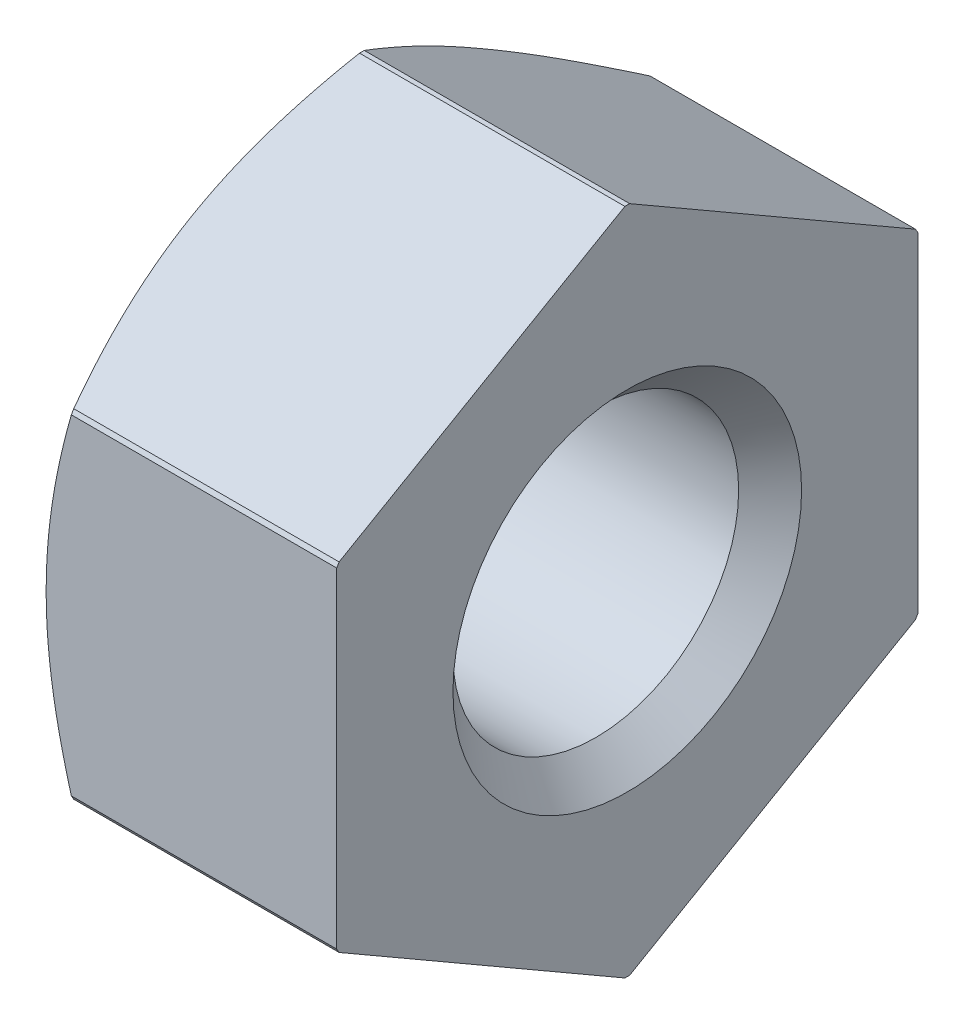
ISO-10303-21;
HEADER;
FILE_DESCRIPTION(('STEP AP214'),'2;1');
FILE_NAME('part.step','',(''),(''),'','','');
FILE_SCHEMA(('AUTOMOTIVE_DESIGN { 1 0 10303 214 1 1 1 1 }'));
ENDSEC;
DATA;
#1=APPLICATION_CONTEXT('core data for automotive mechanical design processes');
#2=APPLICATION_PROTOCOL_DEFINITION('international standard','automotive_design',2000,#1);
#3=PRODUCT_CONTEXT('',#1,'mechanical');
#4=PRODUCT('Part','Part','',(#3));
#5=PRODUCT_RELATED_PRODUCT_CATEGORY('part','',(#4));
#6=PRODUCT_DEFINITION_FORMATION('','',#4);
#7=PRODUCT_DEFINITION_CONTEXT('part definition',#1,'design');
#8=PRODUCT_DEFINITION('design','',#6,#7);
#9=PRODUCT_DEFINITION_SHAPE('','',#8);
#10=(LENGTH_UNIT() NAMED_UNIT(*) SI_UNIT(.MILLI.,.METRE.));
#11=(NAMED_UNIT(*) PLANE_ANGLE_UNIT() SI_UNIT($,.RADIAN.));
#12=(NAMED_UNIT(*) SI_UNIT($,.STERADIAN.) SOLID_ANGLE_UNIT());
#13=UNCERTAINTY_MEASURE_WITH_UNIT(LENGTH_MEASURE(1.E-05),#10,'distance_accuracy_value','');
#14=(GEOMETRIC_REPRESENTATION_CONTEXT(3) GLOBAL_UNCERTAINTY_ASSIGNED_CONTEXT((#13)) GLOBAL_UNIT_ASSIGNED_CONTEXT((#10,
#11,#12)) REPRESENTATION_CONTEXT('',''));
#15=CARTESIAN_POINT('',(0.,0.,0.));
#16=DIRECTION('',(0.,0.,1.));
#17=DIRECTION('',(1.,0.,0.));
#18=AXIS2_PLACEMENT_3D('',#15,#16,#17);
#19=CARTESIAN_POINT('',(-2.5,0.,0.));
#20=DIRECTION('',(1.,0.,0.));
#21=DIRECTION('',(0.,0.,-1.));
#22=AXIS2_PLACEMENT_3D('',#19,#20,#21);
#23=CONICAL_SURFACE('',#22,5.,1.04719755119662);
#24=CARTESIAN_POINT('',(-2.0669872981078,0.,0.));
#25=DIRECTION('',(1.,0.,0.));
#26=DIRECTION('',(0.,-0.493818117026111,0.869565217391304));
#27=AXIS2_PLACEMENT_3D('',#24,#25,#26);
#28=CIRCLE('',#27,5.75);
#29=CARTESIAN_POINT('',(-2.0669872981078,-2.83945417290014,5.));
#30=VERTEX_POINT('',#29);
#31=CARTESIAN_POINT('',(-2.0669872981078,-2.91039993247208,4.95903944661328));
#32=VERTEX_POINT('',#31);
#33=EDGE_CURVE('E146',#30,#32,#28,.T.);
#34=ORIENTED_EDGE('',*,*,#33,.F.);
#35=CARTESIAN_POINT('',(-2.06698731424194,-2.83945411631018,5.));
#36=CARTESIAN_POINT('',(-2.08478329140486,-2.77703756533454,4.99999559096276));
#37=CARTESIAN_POINT('',(-2.10224609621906,-2.71452454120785,4.99983212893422));
#38=CARTESIAN_POINT('',(-2.13569371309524,-2.59173996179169,4.99938322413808));
#39=CARTESIAN_POINT('',(-2.1517096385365,-2.53147685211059,4.99910282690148));
#40=CARTESIAN_POINT('',(-2.18237806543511,-2.41263407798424,4.9985952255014));
#41=CARTESIAN_POINT('',(-2.19705766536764,-2.35406143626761,4.99836661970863));
#42=CARTESIAN_POINT('',(-2.22517120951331,-2.23805729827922,4.99805695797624));
#43=CARTESIAN_POINT('',(-2.23862617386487,-2.18063091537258,4.99797259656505));
#44=CARTESIAN_POINT('',(-2.2644086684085,-2.06639137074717,4.99798175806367));
#45=CARTESIAN_POINT('',(-2.27674960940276,-2.0095812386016,4.9980727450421));
#46=CARTESIAN_POINT('',(-2.30042819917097,-1.89606269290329,4.99839021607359));
#47=CARTESIAN_POINT('',(-2.31177075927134,-1.8393553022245,4.99861598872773));
#48=CARTESIAN_POINT('',(-2.33356032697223,-1.72554457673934,4.99913128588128));
#49=CARTESIAN_POINT('',(-2.34400374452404,-1.66844055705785,4.99942105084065));
#50=CARTESIAN_POINT('',(-2.36416565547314,-1.55336753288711,4.99981676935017));
#51=CARTESIAN_POINT('',(-2.37387344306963,-1.49539664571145,4.99992037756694));
#52=CARTESIAN_POINT('',(-2.39244783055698,-1.37839208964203,5.00008086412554));
#53=CARTESIAN_POINT('',(-2.40129895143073,-1.31935594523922,5.0001369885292));
#54=CARTESIAN_POINT('',(-2.41792123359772,-1.20052011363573,5.00039627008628));
#55=CARTESIAN_POINT('',(-2.42568050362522,-1.14071876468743,5.00060091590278));
#56=CARTESIAN_POINT('',(-2.44012758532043,-1.0206323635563,5.00095536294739));
#57=CARTESIAN_POINT('',(-2.44680886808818,-0.960346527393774,5.00110483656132));
#58=CARTESIAN_POINT('',(-2.45904362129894,-0.839549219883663,5.00131147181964));
#59=CARTESIAN_POINT('',(-2.46459501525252,-0.779037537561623,5.0013684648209));
#60=CARTESIAN_POINT('',(-2.47453178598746,-0.658037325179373,5.00136325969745));
#61=CARTESIAN_POINT('',(-2.47891941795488,-0.597548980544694,5.00130129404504));
#62=CARTESIAN_POINT('',(-2.4864853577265,-0.476831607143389,5.00108395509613));
#63=CARTESIAN_POINT('',(-2.48967020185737,-0.416602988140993,5.00092909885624));
#64=CARTESIAN_POINT('',(-2.49479007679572,-0.296629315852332,5.00058759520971));
#65=CARTESIAN_POINT('',(-2.49673598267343,-0.236884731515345,5.00040124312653));
#66=CARTESIAN_POINT('',(-2.4993313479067,-0.118093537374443,5.00011218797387));
#67=CARTESIAN_POINT('',(-2.49999626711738,-0.0590472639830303,5.00000849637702));
#68=CARTESIAN_POINT('',(-2.49999999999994,9.88570368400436E-07,5.));
#69=B_SPLINE_CURVE_WITH_KNOTS('',3,(#35,#36,#37,#38,#39,#40,#41,#42,#43,#44,#45,#46,#47,#48,#49,
#50,#51,#52,#53,#54,#55,#56,#57,#58,#59,#60,#61,#62,#63,#64,#65,#66,#67,#68),.UNSPECIFIED.,.F.,
.F.,(4,2,2,2,2,2,2,2,2,2,2,2,2,2,2,2,4),(0.,0.194712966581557,0.381774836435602,
0.562921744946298,0.739858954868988,0.914256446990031,1.0877415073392,1.26188990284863,
1.43821735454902,1.61729458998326,1.79819199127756,1.98014691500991,2.162433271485,
2.34436376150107,2.52529084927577,2.70460707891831,2.88174529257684),.UNSPECIFIED.);
#70=CARTESIAN_POINT('',(-2.5,0.,5.));
#71=VERTEX_POINT('',#70);
#72=EDGE_CURVE('E129',#30,#71,#69,.T.);
#73=ORIENTED_EDGE('',*,*,#72,.T.);
#74=CARTESIAN_POINT('',(-2.5,0.,0.));
#75=DIRECTION('',(1.,0.,0.));
#76=DIRECTION('',(0.,0.,1.));
#77=AXIS2_PLACEMENT_3D('',#74,#75,#76);
#78=CIRCLE('',#77,5.);
#79=CARTESIAN_POINT('',(-2.5,-4.33012701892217,2.50000000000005));
#80=VERTEX_POINT('',#79);
#81=EDGE_CURVE('E145',#71,#80,#78,.T.);
#82=ORIENTED_EDGE('',*,*,#81,.T.);
#83=CARTESIAN_POINT('',(-2.5,-4.33012711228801,2.49999983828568));
#84=CARTESIAN_POINT('',(-2.49998648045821,-4.30997495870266,2.53495215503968));
#85=CARTESIAN_POINT('',(-2.49970615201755,-4.28979917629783,2.56989118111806));
#86=CARTESIAN_POINT('',(-2.49859188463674,-4.2496039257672,2.6394812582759));
#87=CARTESIAN_POINT('',(-2.49776235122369,-4.22958448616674,2.67413239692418));
#88=CARTESIAN_POINT('',(-2.49554185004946,-4.18979340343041,2.74307720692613));
#89=CARTESIAN_POINT('',(-2.49415683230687,-4.17002135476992,2.77737083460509));
#90=CARTESIAN_POINT('',(-2.49082146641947,-4.13042670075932,2.84611616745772));
#91=CARTESIAN_POINT('',(-2.48886849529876,-4.11060429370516,2.8805678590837));
#92=CARTESIAN_POINT('',(-2.48441333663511,-4.0709006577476,2.94958332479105));
#93=CARTESIAN_POINT('',(-2.48190901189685,-4.05101950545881,2.98414700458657));
#94=CARTESIAN_POINT('',(-2.47636175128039,-4.01120424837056,3.05334546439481));
#95=CARTESIAN_POINT('',(-2.47331715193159,-3.99127017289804,3.08798012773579));
#96=CARTESIAN_POINT('',(-2.46670141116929,-3.95135861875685,3.15727880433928));
#97=CARTESIAN_POINT('',(-2.46312909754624,-3.93138114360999,3.19194270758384));
#98=CARTESIAN_POINT('',(-2.45546961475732,-3.89139905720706,3.26125896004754));
#99=CARTESIAN_POINT('',(-2.45138177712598,-3.87139444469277,3.2959112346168));
#100=CARTESIAN_POINT('',(-2.44270291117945,-3.83138074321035,3.36516394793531));
#101=CARTESIAN_POINT('',(-2.43811173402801,-3.81137165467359,3.39976436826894));
#102=CARTESIAN_POINT('',(-2.42843823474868,-3.7713775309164,3.46887350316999));
#103=CARTESIAN_POINT('',(-2.42335630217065,-3.75139248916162,3.50338226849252));
#104=CARTESIAN_POINT('',(-2.41271172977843,-3.7114844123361,3.57227030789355));
#105=CARTESIAN_POINT('',(-2.40715004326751,-3.69156133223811,3.60664970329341));
#106=CARTESIAN_POINT('',(-2.3955623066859,-3.65181192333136,3.67523749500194));
#107=CARTESIAN_POINT('',(-2.38953778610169,-3.63198548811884,3.70944608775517));
#108=CARTESIAN_POINT('',(-2.3770186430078,-3.59250861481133,3.77766919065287));
#109=CARTESIAN_POINT('',(-2.37052624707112,-3.57285778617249,3.81168388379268));
#110=CARTESIAN_POINT('',(-2.35716644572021,-3.53373538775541,3.87933615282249));
#111=CARTESIAN_POINT('',(-2.3503027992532,-3.51426374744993,3.9129744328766));
#112=CARTESIAN_POINT('',(-2.33626063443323,-3.47546214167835,3.97982106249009));
#113=CARTESIAN_POINT('',(-2.32908577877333,-3.45613261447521,4.01303043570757));
#114=CARTESIAN_POINT('',(-2.31437044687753,-3.41761702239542,4.07918650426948));
#115=CARTESIAN_POINT('',(-2.3068323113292,-3.39843077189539,4.11213361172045));
#116=CARTESIAN_POINT('',(-2.29136198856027,-3.36015221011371,4.17791206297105));
#117=CARTESIAN_POINT('',(-2.28343049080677,-3.34105979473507,4.21074350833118));
#118=CARTESIAN_POINT('',(-2.26713930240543,-3.30291611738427,4.27643892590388));
#119=CARTESIAN_POINT('',(-2.25877859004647,-3.28386507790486,4.30930277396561));
#120=CARTESIAN_POINT('',(-2.24159643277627,-3.24573578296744,4.37520670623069));
#121=CARTESIAN_POINT('',(-2.2327722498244,-3.22665821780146,4.40824647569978));
#122=CARTESIAN_POINT('',(-2.21463016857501,-3.18839542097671,4.47464274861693));
#123=CARTESIAN_POINT('',(-2.20530788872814,-3.16921133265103,4.50799871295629));
#124=CARTESIAN_POINT('',(-2.18613662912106,-3.13064213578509,4.57516407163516));
#125=CARTESIAN_POINT('',(-2.17628177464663,-3.11125843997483,4.60897259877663));
#126=CARTESIAN_POINT('',(-2.15601217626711,-3.07218382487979,4.67717581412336));
#127=CARTESIAN_POINT('',(-2.14559027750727,-3.05249424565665,4.711569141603));
#128=CARTESIAN_POINT('',(-2.12415313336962,-3.01268893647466,4.78107053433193));
#129=CARTESIAN_POINT('',(-2.11312971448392,-2.9925739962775,4.81617652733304));
#130=CARTESIAN_POINT('',(-2.09045591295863,-2.95178441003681,4.88722672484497));
#131=CARTESIAN_POINT('',(-2.07879663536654,-2.93110936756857,4.92316786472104));
#132=CARTESIAN_POINT('',(-2.06698729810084,-2.91039993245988,4.95903944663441));
#133=B_SPLINE_CURVE_WITH_KNOTS('',3,(#83,#84,#85,#86,#87,#88,#89,#90,#91,#92,#93,#94,#95,#96,
#97,#98,#99,#100,#101,#102,#103,#104,#105,#106,#107,#108,#109,#110,#111,#112,#113,#114,#115,
#116,#117,#118,#119,#120,#121,#122,#123,#124,#125,#126,#127,#128,#129,#130,#131,#132),
.UNSPECIFIED.,.F.,.F.,(4,2,2,2,2,2,2,2,2,2,2,2,2,2,2,2,2,2,2,2,2,2,2,2,4),(0.,0.121036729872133,
0.241114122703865,0.359938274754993,0.479320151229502,0.599173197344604,0.719401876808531,
0.839901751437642,0.960559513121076,1.08125304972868,1.20185155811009,1.32221571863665,
1.44219794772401,1.5616427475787,1.68004716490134,1.79731294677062,1.91390414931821,
2.03029775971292,2.14698259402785,2.26445808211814,2.3832330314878,2.50382447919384,
2.62675674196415,2.75256076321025,2.88177383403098),.UNSPECIFIED.);
#134=EDGE_CURVE('E160',#80,#32,#133,.T.);
#135=ORIENTED_EDGE('',*,*,#134,.T.);
#136=EDGE_LOOP('',(#34,#73,#82,#135));
#137=FACE_BOUND('',#136,.T.);
#138=ADVANCED_FACE('F16',(#137),#23,.T.);
#139=CARTESIAN_POINT('',(2.5,0.,0.));
#140=DIRECTION('',(1.,0.,0.));
#141=DIRECTION('',(0.,0.,-1.));
#142=AXIS2_PLACEMENT_3D('',#139,#140,#141);
#143=CYLINDRICAL_SURFACE('',#142,5.75);
#144=CARTESIAN_POINT('',(2.5,0.,0.));
#145=DIRECTION('',(1.,0.,0.));
#146=DIRECTION('',(0.,-0.493818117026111,0.869565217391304));
#147=AXIS2_PLACEMENT_3D('',#144,#145,#146);
#148=CIRCLE('',#147,5.75);
#149=CARTESIAN_POINT('',(2.5,-2.83945417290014,5.));
#150=VERTEX_POINT('',#149);
#151=CARTESIAN_POINT('',(2.5,-2.91039993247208,4.95903944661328));
#152=VERTEX_POINT('',#151);
#153=EDGE_CURVE('E154',#150,#152,#148,.T.);
#154=ORIENTED_EDGE('',*,*,#153,.F.);
#155=DIRECTION('',(-1.,0.,0.));
#156=VECTOR('',#155,1.);
#157=CARTESIAN_POINT('',(2.5,-2.83945417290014,5.));
#158=LINE('',#157,#156);
#159=EDGE_CURVE('E134',#150,#30,#158,.T.);
#160=ORIENTED_EDGE('',*,*,#159,.T.);
#161=ORIENTED_EDGE('',*,*,#33,.T.);
#162=DIRECTION('',(1.,0.,0.));
#163=VECTOR('',#162,1.);
#164=CARTESIAN_POINT('',(-2.0669872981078,-2.91039993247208,4.95903944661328));
#165=LINE('',#164,#163);
#166=EDGE_CURVE('E156',#32,#152,#165,.T.);
#167=ORIENTED_EDGE('',*,*,#166,.T.);
#168=EDGE_LOOP('',(#154,#160,#161,#167));
#169=FACE_BOUND('',#168,.T.);
#170=ADVANCED_FACE('F152',(#169),#143,.T.);
#171=CARTESIAN_POINT('',(2.5,2.8867513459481,5.));
#172=DIRECTION('',(0.,0.,-1.));
#173=DIRECTION('',(-1.,0.,0.));
#174=AXIS2_PLACEMENT_3D('',#171,#172,#173);
#175=PLANE('',#174);
#176=CARTESIAN_POINT('',(-2.49999999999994,9.88570368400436E-07,5.));
#177=CARTESIAN_POINT('',(-2.5000002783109,0.0173495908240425,4.99999953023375));
#178=CARTESIAN_POINT('',(-2.49994835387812,0.034698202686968,4.99999915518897));
#179=CARTESIAN_POINT('',(-2.49974060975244,0.0691048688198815,5.00000084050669));
#180=CARTESIAN_POINT('',(-2.49958654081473,0.0861629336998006,5.00000286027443));
#181=CARTESIAN_POINT('',(-2.49917497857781,0.120286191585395,5.00001141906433));
#182=CARTESIAN_POINT('',(-2.49891743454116,0.137351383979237,5.00001796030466));
#183=CARTESIAN_POINT('',(-2.49829988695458,0.171488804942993,5.00003382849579));
#184=CARTESIAN_POINT('',(-2.49793983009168,0.188561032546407,5.0000431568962));
#185=CARTESIAN_POINT('',(-2.49711760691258,0.22271239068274,5.00006398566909));
#186=CARTESIAN_POINT('',(-2.49665538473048,0.239791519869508,5.0000754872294));
#187=CARTESIAN_POINT('',(-2.49562934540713,0.273956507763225,5.00009982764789));
#188=CARTESIAN_POINT('',(-2.49506547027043,0.291042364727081,5.00011266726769));
#189=CARTESIAN_POINT('',(-2.4938365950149,0.32522059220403,5.00013898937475));
#190=CARTESIAN_POINT('',(-2.49317153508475,0.342312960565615,5.00015247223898));
#191=CARTESIAN_POINT('',(-2.49174077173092,0.376503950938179,5.00017943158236));
#192=CARTESIAN_POINT('',(-2.49097500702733,0.393602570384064,5.00019290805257));
#193=CARTESIAN_POINT('',(-2.48934331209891,0.427805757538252,5.00021927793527));
#194=CARTESIAN_POINT('',(-2.48847731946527,0.444910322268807,5.00023217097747));
#195=CARTESIAN_POINT('',(-2.48664564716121,0.479125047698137,5.00025686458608));
#196=CARTESIAN_POINT('',(-2.48567990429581,0.496235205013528,5.00026866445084));
#197=CARTESIAN_POINT('',(-2.4836492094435,0.530460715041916,5.00029073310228));
#198=CARTESIAN_POINT('',(-2.48258419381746,0.547576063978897,5.0003010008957));
#199=CARTESIAN_POINT('',(-2.4803554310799,0.581811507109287,5.00031963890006));
#200=CARTESIAN_POINT('',(-2.4791916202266,0.59893159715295,5.00032800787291));
#201=CARTESIAN_POINT('',(-2.47676574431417,0.633176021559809,5.0003425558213));
#202=CARTESIAN_POINT('',(-2.47550361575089,0.650300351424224,5.00034873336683));
#203=CARTESIAN_POINT('',(-2.47288158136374,0.684552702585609,5.0003586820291));
#204=CARTESIAN_POINT('',(-2.47152161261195,0.701680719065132,5.00036245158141));
#205=CARTESIAN_POINT('',(-2.4687043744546,0.73593983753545,5.00036744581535));
#206=CARTESIAN_POINT('',(-2.46724704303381,0.753070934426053,5.00036866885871));
#207=CARTESIAN_POINT('',(-2.46423555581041,0.787335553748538,5.00036851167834));
#208=CARTESIAN_POINT('',(-2.4626813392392,0.804469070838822,5.00036712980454));
#209=CARTESIAN_POINT('',(-2.45947655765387,0.838737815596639,5.00036178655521));
#210=CARTESIAN_POINT('',(-2.45782593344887,0.855873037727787,5.00035782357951));
#211=CARTESIAN_POINT('',(-2.45442881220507,0.890144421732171,5.00034742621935));
#212=CARTESIAN_POINT('',(-2.45268225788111,0.907280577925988,5.00034099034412));
#213=CARTESIAN_POINT('',(-2.44909375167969,0.941553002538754,5.00032584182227));
#214=CARTESIAN_POINT('',(-2.44725174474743,0.958689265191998,5.0003171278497));
#215=CARTESIAN_POINT('',(-2.44347280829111,0.992961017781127,5.00029770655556));
#216=CARTESIAN_POINT('',(-2.44153582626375,1.01009650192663,5.00028699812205));
#217=CARTESIAN_POINT('',(-2.43756741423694,1.04436575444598,5.00026396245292));
#218=CARTESIAN_POINT('',(-2.43553593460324,1.06149951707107,5.00025163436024));
#219=CARTESIAN_POINT('',(-2.43137900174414,1.09576432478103,5.00022582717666));
#220=CARTESIAN_POINT('',(-2.42925350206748,1.11289536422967,5.00021234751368));
#221=CARTESIAN_POINT('',(-2.42490900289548,1.14715366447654,5.00018480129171));
#222=CARTESIAN_POINT('',(-2.42268996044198,1.16428091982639,5.00017073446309));
#223=CARTESIAN_POINT('',(-2.41815885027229,1.19853053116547,5.00014267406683));
#224=CARTESIAN_POINT('',(-2.41584674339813,1.21565288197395,5.00012868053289));
#225=CARTESIAN_POINT('',(-2.41112997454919,1.24989150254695,5.00010153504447));
#226=CARTESIAN_POINT('',(-2.4087252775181,1.26700776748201,5.00008838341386));
#227=CARTESIAN_POINT('',(-2.40382381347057,1.30123297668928,5.00006376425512));
#228=CARTESIAN_POINT('',(-2.40132701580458,1.31834191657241,5.00005229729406));
#229=CARTESIAN_POINT('',(-2.39624177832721,1.35255116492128,5.00003210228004));
#230=CARTESIAN_POINT('',(-2.39365331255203,1.3696514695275,5.00002337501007));
#231=CARTESIAN_POINT('',(-2.38838537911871,1.40384211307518,5.00000942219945));
#232=CARTESIAN_POINT('',(-2.38570589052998,1.42093244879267,5.00000419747));
#233=CARTESIAN_POINT('',(-2.3802576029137,1.45509004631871,4.9999996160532));
#234=CARTESIAN_POINT('',(-2.37748884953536,1.47215731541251,5.00000025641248));
#235=CARTESIAN_POINT('',(-2.37188033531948,1.50620784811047,4.99999446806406));
#236=CARTESIAN_POINT('',(-2.36904091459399,1.52319116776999,4.99998806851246));
#237=CARTESIAN_POINT('',(-2.36329042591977,1.55707478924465,4.99997270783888));
#238=CARTESIAN_POINT('',(-2.3603796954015,1.57397514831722,4.99996375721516));
#239=CARTESIAN_POINT('',(-2.35448549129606,1.60770506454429,4.99994505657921));
#240=CARTESIAN_POINT('',(-2.3515022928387,1.62453466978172,4.99993530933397));
#241=CARTESIAN_POINT('',(-2.34546172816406,1.65813531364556,4.99991691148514));
#242=CARTESIAN_POINT('',(-2.34240457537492,1.67490639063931,4.99990825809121));
#243=CARTESIAN_POINT('',(-2.33621476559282,1.70840229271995,4.99989331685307));
#244=CARTESIAN_POINT('',(-2.3330822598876,1.72512714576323,4.99988702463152));
#245=CARTESIAN_POINT('',(-2.32674038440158,1.75854297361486,4.99987765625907));
#246=CARTESIAN_POINT('',(-2.32353110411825,1.77523396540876,4.99987457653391));
#247=CARTESIAN_POINT('',(-2.31703432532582,1.80859450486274,4.99987201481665));
#248=CARTESIAN_POINT('',(-2.31374685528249,1.8252640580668,4.99987253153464));
#249=CARTESIAN_POINT('',(-2.30709234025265,1.85859421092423,4.99987709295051));
#250=CARTESIAN_POINT('',(-2.3037252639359,1.87525480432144,4.99988113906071));
#251=CARTESIAN_POINT('',(-2.2969101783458,1.90857958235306,4.99989223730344));
#252=CARTESIAN_POINT('',(-2.29346207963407,1.92524374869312,4.99989929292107));
#253=CARTESIAN_POINT('',(-2.28648359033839,1.95858826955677,4.99991543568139));
#254=CARTESIAN_POINT('',(-2.2829530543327,1.97526859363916,4.99992452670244));
#255=CARTESIAN_POINT('',(-2.27580832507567,2.00865807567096,4.99994332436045));
#256=CARTESIAN_POINT('',(-2.27219393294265,2.02536719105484,4.9999530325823));
#257=CARTESIAN_POINT('',(-2.26488013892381,2.05882695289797,4.99997116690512));
#258=CARTESIAN_POINT('',(-2.26118048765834,2.07557754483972,4.99997958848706));
#259=CARTESIAN_POINT('',(-2.25369476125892,2.1091329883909,4.99999291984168));
#260=CARTESIAN_POINT('',(-2.24990838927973,2.12593777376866,4.99999781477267));
#261=CARTESIAN_POINT('',(-2.24226169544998,2.15955432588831,5.0000009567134));
#262=CARTESIAN_POINT('',(-2.2384012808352,2.17636607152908,4.99999919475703));
#263=CARTESIAN_POINT('',(-2.23063268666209,2.20987624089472,4.99999360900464));
#264=CARTESIAN_POINT('',(-2.22672491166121,2.22657475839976,4.99998979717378));
#265=CARTESIAN_POINT('',(-2.2188557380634,2.25988661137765,4.99998302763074));
#266=CARTESIAN_POINT('',(-2.21489462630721,2.27650001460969,4.99998006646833));
#267=CARTESIAN_POINT('',(-2.20691145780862,2.30967661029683,4.99997660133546));
#268=CARTESIAN_POINT('',(-2.20288954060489,2.32623983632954,4.99997609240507));
#269=CARTESIAN_POINT('',(-2.19477745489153,2.35935142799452,4.99997775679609));
#270=CARTESIAN_POINT('',(-2.19068727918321,2.37589979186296,4.99997993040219));
#271=CARTESIAN_POINT('',(-2.1824313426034,2.40901736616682,4.99998589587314));
#272=CARTESIAN_POINT('',(-2.17826543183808,2.42558653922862,4.99998969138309));
#273=CARTESIAN_POINT('',(-2.16985077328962,2.45878181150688,4.99999632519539));
#274=CARTESIAN_POINT('',(-2.16560174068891,2.47540783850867,4.99999915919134));
#275=CARTESIAN_POINT('',(-2.15703680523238,2.50866170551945,5.0000006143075));
#276=CARTESIAN_POINT('',(-2.15272083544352,2.52528952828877,4.99999923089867));
#277=CARTESIAN_POINT('',(-2.14404303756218,2.55845972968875,4.99999730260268));
#278=CARTESIAN_POINT('',(-2.1396814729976,2.57500217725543,4.99999675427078));
#279=CARTESIAN_POINT('',(-2.13089514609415,2.60807223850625,4.99999735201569));
#280=CARTESIAN_POINT('',(-2.12647037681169,2.62459985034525,4.99999849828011));
#281=CARTESIAN_POINT('',(-2.11754591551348,2.65769261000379,4.99999971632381));
#282=CARTESIAN_POINT('',(-2.11304602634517,2.67425770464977,4.99999978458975));
#283=CARTESIAN_POINT('',(-2.10399344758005,2.70734387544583,4.99999992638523));
#284=CARTESIAN_POINT('',(-2.09944085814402,2.72386497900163,4.99999999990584));
#285=CARTESIAN_POINT('',(-2.09027747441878,2.75688792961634,4.99999985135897));
#286=CARTESIAN_POINT('',(-2.08566669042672,2.77338977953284,4.99999962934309));
#287=CARTESIAN_POINT('',(-2.07637587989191,2.80641604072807,4.99999946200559));
#288=CARTESIAN_POINT('',(-2.0716957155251,2.82294041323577,4.99999951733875));
#289=CARTESIAN_POINT('',(-2.06698662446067,2.83945653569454,5.));
#290=B_SPLINE_CURVE_WITH_KNOTS('',3,(#176,#177,#178,#179,#180,#181,#182,#183,#184,#185,#186,
#187,#188,#189,#190,#191,#192,#193,#194,#195,#196,#197,#198,#199,#200,#201,#202,#203,#204,#205,
#206,#207,#208,#209,#210,#211,#212,#213,#214,#215,#216,#217,#218,#219,#220,#221,#222,#223,#224,
#225,#226,#227,#228,#229,#230,#231,#232,#233,#234,#235,#236,#237,#238,#239,#240,#241,#242,#243,
#244,#245,#246,#247,#248,#249,#250,#251,#252,#253,#254,#255,#256,#257,#258,#259,#260,#261,#262,
#263,#264,#265,#266,#267,#268,#269,#270,#271,#272,#273,#274,#275,#276,#277,#278,#279,#280,#281,
#282,#283,#284,#285,#286,#287,#288,#289),.UNSPECIFIED.,.F.,.F.,(4,2,2,2,2,2,2,2,2,2,2,2,2,2,2,2,
2,2,2,2,2,2,2,2,2,2,2,2,2,2,2,2,2,2,2,2,2,2,2,2,2,2,2,2,2,2,2,2,2,2,2,2,2,2,2,2,4),(0.,
0.0520457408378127,0.103221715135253,0.154422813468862,0.20565058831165,0.256906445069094,
0.308191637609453,0.359507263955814,0.410854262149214,0.462233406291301,0.513645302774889,
0.565090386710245,0.616568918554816,0.668080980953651,0.719626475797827,0.771205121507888,
0.822816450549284,0.874459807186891,0.926134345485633,0.977839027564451,1.02957262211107,
1.0813337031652,1.13312064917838,1.18493164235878,1.23676466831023,1.28861751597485,
1.34048777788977,1.39237285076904,1.44426993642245,1.49614089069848,1.54779782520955,
1.59924517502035,1.65052085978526,1.70166298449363,1.75270982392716,1.80369980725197,
1.85467150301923,1.90566360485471,1.95671491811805,2.00786434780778,2.05915088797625,
2.11061361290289,2.16229167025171,2.21403935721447,2.26548821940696,2.31672536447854,
2.36785883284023,2.41899772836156,2.47025216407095,2.52173321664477,2.5732695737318,
2.62459275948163,2.67592162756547,2.72741774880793,2.77882830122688,2.8302298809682,
2.88175286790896),.UNSPECIFIED.);
#291=CARTESIAN_POINT('',(-2.0669872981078,2.83945417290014,5.));
#292=VERTEX_POINT('',#291);
#293=EDGE_CURVE('E137',#71,#292,#290,.T.);
#294=ORIENTED_EDGE('',*,*,#293,.F.);
#295=ORIENTED_EDGE('',*,*,#72,.F.);
#296=ORIENTED_EDGE('',*,*,#159,.F.);
#297=DIRECTION('',(0.,-1.,0.));
#298=VECTOR('',#297,1.);
#299=CARTESIAN_POINT('',(2.5,2.83945417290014,5.));
#300=LINE('',#299,#298);
#301=CARTESIAN_POINT('',(2.5,2.83945417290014,5.));
#302=VERTEX_POINT('',#301);
#303=EDGE_CURVE('E294',#302,#150,#300,.T.);
#304=ORIENTED_EDGE('',*,*,#303,.F.);
#305=DIRECTION('',(1.,0.,0.));
#306=VECTOR('',#305,1.);
#307=CARTESIAN_POINT('',(-2.0669872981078,2.83945417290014,5.));
#308=LINE('',#307,#306);
#309=EDGE_CURVE('E288',#292,#302,#308,.T.);
#310=ORIENTED_EDGE('',*,*,#309,.F.);
#311=EDGE_LOOP('',(#294,#295,#296,#304,#310));
#312=FACE_BOUND('',#311,.T.);
#313=ADVANCED_FACE('F132',(#312),#175,.F.);
#314=CARTESIAN_POINT('',(-2.5,0.,0.));
#315=DIRECTION('',(1.,0.,0.));
#316=DIRECTION('',(0.,0.,-1.));
#317=AXIS2_PLACEMENT_3D('',#314,#315,#316);
#318=PLANE('',#317);
#319=CARTESIAN_POINT('',(-2.5,0.,0.));
#320=DIRECTION('',(1.,0.,0.));
#321=DIRECTION('',(0.,0.866025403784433,-0.50000000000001));
#322=AXIS2_PLACEMENT_3D('',#319,#320,#321);
#323=CIRCLE('',#322,5.);
#324=CARTESIAN_POINT('',(-2.5,4.33012701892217,-2.50000000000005));
#325=VERTEX_POINT('',#324);
#326=CARTESIAN_POINT('',(-2.5,4.33012701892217,2.50000000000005));
#327=VERTEX_POINT('',#326);
#328=EDGE_CURVE('E270',#325,#327,#323,.T.);
#329=ORIENTED_EDGE('',*,*,#328,.F.);
#330=CARTESIAN_POINT('',(-2.5,0.,0.));
#331=DIRECTION('',(1.,0.,0.));
#332=DIRECTION('',(0.,0.,-1.));
#333=AXIS2_PLACEMENT_3D('',#330,#331,#332);
#334=CIRCLE('',#333,5.);
#335=CARTESIAN_POINT('',(-2.5,0.,-5.));
#336=VERTEX_POINT('',#335);
#337=EDGE_CURVE('E287',#336,#325,#334,.T.);
#338=ORIENTED_EDGE('',*,*,#337,.F.);
#339=CARTESIAN_POINT('',(-2.5,0.,0.));
#340=DIRECTION('',(1.,0.,0.));
#341=DIRECTION('',(0.,-0.866025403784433,-0.500000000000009));
#342=AXIS2_PLACEMENT_3D('',#339,#340,#341);
#343=CIRCLE('',#342,5.);
#344=CARTESIAN_POINT('',(-2.5,-4.33012701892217,-2.50000000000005));
#345=VERTEX_POINT('',#344);
#346=EDGE_CURVE('E292',#345,#336,#343,.T.);
#347=ORIENTED_EDGE('',*,*,#346,.F.);
#348=CARTESIAN_POINT('',(-2.5,0.,0.));
#349=DIRECTION('',(1.,0.,0.));
#350=DIRECTION('',(0.,-0.866025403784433,0.50000000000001));
#351=AXIS2_PLACEMENT_3D('',#348,#349,#350);
#352=CIRCLE('',#351,5.);
#353=EDGE_CURVE('E275',#80,#345,#352,.T.);
#354=ORIENTED_EDGE('',*,*,#353,.F.);
#355=ORIENTED_EDGE('',*,*,#81,.F.);
#356=CARTESIAN_POINT('',(-2.5,0.,0.));
#357=DIRECTION('',(1.,0.,0.));
#358=DIRECTION('',(0.,0.866025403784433,0.500000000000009));
#359=AXIS2_PLACEMENT_3D('',#356,#357,#358);
#360=CIRCLE('',#359,5.);
#361=EDGE_CURVE('E259',#327,#71,#360,.T.);
#362=ORIENTED_EDGE('',*,*,#361,.F.);
#363=EDGE_LOOP('',(#329,#338,#347,#354,#355,#362));
#364=FACE_BOUND('',#363,.T.);
#365=CARTESIAN_POINT('',(-2.5,0.,0.));
#366=DIRECTION('',(1.,0.,0.));
#367=DIRECTION('',(0.,0.,-1.));
#368=AXIS2_PLACEMENT_3D('',#365,#366,#367);
#369=CIRCLE('',#368,3.);
#370=CARTESIAN_POINT('',(-2.5,0.,-3.));
#371=VERTEX_POINT('',#370);
#372=EDGE_CURVE('E274',#371,#371,#369,.T.);
#373=ORIENTED_EDGE('',*,*,#372,.T.);
#374=EDGE_LOOP('',(#373));
#375=FACE_BOUND('',#374,.T.);
#376=ADVANCED_FACE('F267',(#364,#375),#318,.F.);
#377=CARTESIAN_POINT('',(2.5,-2.8867513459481,5.));
#378=DIRECTION('',(0.,0.866025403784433,-0.500000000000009));
#379=DIRECTION('',(0.,0.500000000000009,0.866025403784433));
#380=AXIS2_PLACEMENT_3D('',#377,#378,#379);
#381=PLANE('',#380);
#382=ORIENTED_EDGE('',*,*,#134,.F.);
#383=CARTESIAN_POINT('',(-2.06698729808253,-5.74985410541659,0.0409605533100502));
#384=CARTESIAN_POINT('',(-2.08483743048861,-5.71854708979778,0.0951771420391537));
#385=CARTESIAN_POINT('',(-2.10234977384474,-5.68705728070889,0.149401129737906));
#386=CARTESIAN_POINT('',(-2.13589323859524,-5.62508763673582,0.255862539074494));
#387=CARTESIAN_POINT('',(-2.15195548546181,-5.59461623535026,0.308095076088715));
#388=CARTESIAN_POINT('',(-2.18271123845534,-5.53455914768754,0.411129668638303));
#389=CARTESIAN_POINT('',(-2.19743192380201,-5.50497580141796,0.461924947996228));
#390=CARTESIAN_POINT('',(-2.22562014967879,-5.44651007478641,0.562588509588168));
#391=CARTESIAN_POINT('',(-2.23910894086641,-5.41762747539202,0.612450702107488));
#392=CARTESIAN_POINT('',(-2.26494939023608,-5.36033157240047,0.711708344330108));
#393=CARTESIAN_POINT('',(-2.27731489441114,-5.33191763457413,0.76109981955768));
#394=CARTESIAN_POINT('',(-2.3010305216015,-5.27527413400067,0.859827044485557));
#395=CARTESIAN_POINT('',(-2.31238620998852,-5.24704447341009,0.909161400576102));
#396=CARTESIAN_POINT('',(-2.33418809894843,-5.19046650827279,1.00815932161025));
#397=CARTESIAN_POINT('',(-2.34463156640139,-5.16211809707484,1.05782342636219));
#398=CARTESIAN_POINT('',(-2.36477574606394,-5.10486607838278,1.15775656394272));
#399=CARTESIAN_POINT('',(-2.37446666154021,-5.07595982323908,1.20802605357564));
#400=CARTESIAN_POINT('',(-2.39299530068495,-5.01760901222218,1.30940210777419));
#401=CARTESIAN_POINT('',(-2.40181871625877,-4.98816270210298,1.36051029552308));
#402=CARTESIAN_POINT('',(-2.41838226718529,-4.92903842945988,1.46340996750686));
#403=CARTESIAN_POINT('',(-2.42611163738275,-4.89936084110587,1.5152034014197));
#404=CARTESIAN_POINT('',(-2.44049628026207,-4.83973891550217,1.61914719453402));
#405=CARTESIAN_POINT('',(-2.4471457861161,-4.80979399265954,1.67129801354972));
#406=CARTESIAN_POINT('',(-2.45931732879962,-4.74972879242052,1.77572741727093));
#407=CARTESIAN_POINT('',(-2.46483779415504,-4.71960832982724,1.82800607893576));
#408=CARTESIAN_POINT('',(-2.47471533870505,-4.65928752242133,1.93247460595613));
#409=CARTESIAN_POINT('',(-2.47907492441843,-4.62908749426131,1.98466441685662));
#410=CARTESIAN_POINT('',(-2.48658989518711,-4.56874051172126,2.08877422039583));
#411=CARTESIAN_POINT('',(-2.48975181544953,-4.53859418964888,2.14069410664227));
#412=CARTESIAN_POINT('',(-2.49483331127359,-4.47851144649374,2.2441098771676));
#413=CARTESIAN_POINT('',(-2.49676349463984,-4.44857549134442,2.29560550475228));
#414=CARTESIAN_POINT('',(-2.49933764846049,-4.38910993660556,2.39805219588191));
#415=CARTESIAN_POINT('',(-2.49999651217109,-4.35957970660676,2.44900252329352));
#416=CARTESIAN_POINT('',(-2.5,-4.33012711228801,2.49999983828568));
#417=B_SPLINE_CURVE_WITH_KNOTS('',3,(#383,#384,#385,#386,#387,#388,#389,#390,#391,#392,#393,
#394,#395,#396,#397,#398,#399,#400,#401,#402,#403,#404,#405,#406,#407,#408,#409,#410,#411,#412,
#413,#414,#415,#416),.UNSPECIFIED.,.F.,.F.,(4,2,2,2,2,2,2,2,2,2,2,2,2,2,2,2,4),(0.,
0.195305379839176,0.383003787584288,0.564788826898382,0.742324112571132,0.917238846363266,
1.09112056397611,1.26550655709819,1.44187558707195,1.62078629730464,1.8013504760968,
1.98284928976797,2.16459903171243,2.34595310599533,2.52630283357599,2.70507763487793,
2.88174509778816),.UNSPECIFIED.);
#418=CARTESIAN_POINT('',(-2.0669872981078,-5.74985410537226,0.0409605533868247));
#419=VERTEX_POINT('',#418);
#420=EDGE_CURVE('E318',#419,#80,#417,.T.);
#421=ORIENTED_EDGE('',*,*,#420,.F.);
#422=DIRECTION('',(-1.,0.,0.));
#423=VECTOR('',#422,1.);
#424=CARTESIAN_POINT('',(2.5,-5.74985410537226,0.0409605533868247));
#425=LINE('',#424,#423);
#426=CARTESIAN_POINT('',(2.5,-5.74985410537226,0.040960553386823));
#427=VERTEX_POINT('',#426);
#428=EDGE_CURVE('E343',#427,#419,#425,.T.);
#429=ORIENTED_EDGE('',*,*,#428,.F.);
#430=DIRECTION('',(0.,-0.500000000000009,-0.866025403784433));
#431=VECTOR('',#430,1.);
#432=CARTESIAN_POINT('',(2.5,-2.91039993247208,4.95903944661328));
#433=LINE('',#432,#431);
#434=EDGE_CURVE('E351',#152,#427,#433,.T.);
#435=ORIENTED_EDGE('',*,*,#434,.F.);
#436=ORIENTED_EDGE('',*,*,#166,.F.);
#437=EDGE_LOOP('',(#382,#421,#429,#435,#436));
#438=FACE_BOUND('',#437,.T.);
#439=ADVANCED_FACE('F327',(#438),#381,.F.);
#440=CARTESIAN_POINT('',(2.5,5.75,0.));
#441=DIRECTION('',(-1.,0.,0.));
#442=DIRECTION('',(0.,0.,1.));
#443=AXIS2_PLACEMENT_3D('',#440,#441,#442);
#444=PLANE('',#443);
#445=CARTESIAN_POINT('',(2.5,0.,0.));
#446=DIRECTION('',(1.,0.,0.));
#447=DIRECTION('',(0.,0.,-1.));
#448=AXIS2_PLACEMENT_3D('',#445,#446,#447);
#449=CIRCLE('',#448,3.);
#450=CARTESIAN_POINT('',(2.5,0.,-3.));
#451=VERTEX_POINT('',#450);
#452=EDGE_CURVE('E357',#451,#451,#449,.T.);
#453=ORIENTED_EDGE('',*,*,#452,.F.);
#454=EDGE_LOOP('',(#453));
#455=FACE_BOUND('',#454,.T.);
#456=CARTESIAN_POINT('',(2.5,0.,0.));
#457=DIRECTION('',(1.,0.,0.));
#458=DIRECTION('',(0.,0.506156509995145,0.862441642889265));
#459=AXIS2_PLACEMENT_3D('',#456,#457,#458);
#460=CIRCLE('',#459,5.75);
#461=CARTESIAN_POINT('',(2.5,2.91039993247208,4.95903944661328));
#462=VERTEX_POINT('',#461);
#463=EDGE_CURVE('E363',#462,#302,#460,.T.);
#464=ORIENTED_EDGE('',*,*,#463,.T.);
#465=ORIENTED_EDGE('',*,*,#303,.T.);
#466=ORIENTED_EDGE('',*,*,#153,.T.);
#467=ORIENTED_EDGE('',*,*,#434,.T.);
#468=CARTESIAN_POINT('',(2.5,0.,0.));
#469=DIRECTION('',(1.,0.,0.));
#470=DIRECTION('',(0.,-0.999974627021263,0.00712357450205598));
#471=AXIS2_PLACEMENT_3D('',#468,#469,#470);
#472=CIRCLE('',#471,5.75);
#473=CARTESIAN_POINT('',(2.5,-5.74985410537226,-0.0409605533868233));
#474=VERTEX_POINT('',#473);
#475=EDGE_CURVE('E367',#427,#474,#472,.T.);
#476=ORIENTED_EDGE('',*,*,#475,.T.);
#477=DIRECTION('',(0.,0.500000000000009,-0.866025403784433));
#478=VECTOR('',#477,1.);
#479=CARTESIAN_POINT('',(2.5,-5.74985410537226,-0.0409605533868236));
#480=LINE('',#479,#478);
#481=CARTESIAN_POINT('',(2.5,-2.91039993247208,-4.95903944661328));
#482=VERTEX_POINT('',#481);
#483=EDGE_CURVE('E373',#474,#482,#480,.T.);
#484=ORIENTED_EDGE('',*,*,#483,.T.);
#485=CARTESIAN_POINT('',(2.5,0.,0.));
#486=DIRECTION('',(1.,0.,0.));
#487=DIRECTION('',(0.,-0.506156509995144,-0.862441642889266));
#488=AXIS2_PLACEMENT_3D('',#485,#486,#487);
#489=CIRCLE('',#488,5.75);
#490=CARTESIAN_POINT('',(2.5,-2.83945417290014,-5.));
#491=VERTEX_POINT('',#490);
#492=EDGE_CURVE('E379',#482,#491,#489,.T.);
#493=ORIENTED_EDGE('',*,*,#492,.T.);
#494=DIRECTION('',(0.,1.,0.));
#495=VECTOR('',#494,1.);
#496=CARTESIAN_POINT('',(2.5,-2.83945417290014,-5.));
#497=LINE('',#496,#495);
#498=CARTESIAN_POINT('',(2.5,2.83945417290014,-5.));
#499=VERTEX_POINT('',#498);
#500=EDGE_CURVE('E385',#491,#499,#497,.T.);
#501=ORIENTED_EDGE('',*,*,#500,.T.);
#502=CARTESIAN_POINT('',(2.5,0.,0.));
#503=DIRECTION('',(1.,0.,0.));
#504=DIRECTION('',(0.,0.493818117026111,-0.869565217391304));
#505=AXIS2_PLACEMENT_3D('',#502,#503,#504);
#506=CIRCLE('',#505,5.75);
#507=CARTESIAN_POINT('',(2.5,2.91039993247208,-4.95903944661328));
#508=VERTEX_POINT('',#507);
#509=EDGE_CURVE('E391',#499,#508,#506,.T.);
#510=ORIENTED_EDGE('',*,*,#509,.T.);
#511=DIRECTION('',(0.,0.500000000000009,0.866025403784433));
#512=VECTOR('',#511,1.);
#513=CARTESIAN_POINT('',(2.5,2.91039993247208,-4.95903944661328));
#514=LINE('',#513,#512);
#515=CARTESIAN_POINT('',(2.5,5.74985410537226,-0.0409605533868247));
#516=VERTEX_POINT('',#515);
#517=EDGE_CURVE('E397',#508,#516,#514,.T.);
#518=ORIENTED_EDGE('',*,*,#517,.T.);
#519=CARTESIAN_POINT('',(2.5,0.,0.));
#520=DIRECTION('',(1.,0.,0.));
#521=DIRECTION('',(0.,0.999974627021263,-0.00712357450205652));
#522=AXIS2_PLACEMENT_3D('',#519,#520,#521);
#523=CIRCLE('',#522,5.75);
#524=CARTESIAN_POINT('',(2.5,5.74985410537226,0.0409605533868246));
#525=VERTEX_POINT('',#524);
#526=EDGE_CURVE('E403',#516,#525,#523,.T.);
#527=ORIENTED_EDGE('',*,*,#526,.T.);
#528=DIRECTION('',(0.,-0.500000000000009,0.866025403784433));
#529=VECTOR('',#528,1.);
#530=CARTESIAN_POINT('',(2.5,5.74985410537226,0.0409605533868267));
#531=LINE('',#530,#529);
#532=EDGE_CURVE('E253',#525,#462,#531,.T.);
#533=ORIENTED_EDGE('',*,*,#532,.T.);
#534=EDGE_LOOP('',(#464,#465,#466,#467,#476,#484,#493,#501,#510,#518,#527,#533));
#535=FACE_BOUND('',#534,.T.);
#536=ADVANCED_FACE('F337',(#455,#535),#444,.F.);
#537=ORIENTED_EDGE('',*,*,#361,.T.);
#538=ORIENTED_EDGE('',*,*,#293,.T.);
#539=CARTESIAN_POINT('',(-2.0669872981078,0.,0.));
#540=DIRECTION('',(1.,0.,0.));
#541=DIRECTION('',(0.,0.506156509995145,0.862441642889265));
#542=AXIS2_PLACEMENT_3D('',#539,#540,#541);
#543=CIRCLE('',#542,5.75);
#544=CARTESIAN_POINT('',(-2.0669872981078,2.91039993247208,4.95903944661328));
#545=VERTEX_POINT('',#544);
#546=EDGE_CURVE('E244',#545,#292,#543,.T.);
#547=ORIENTED_EDGE('',*,*,#546,.F.);
#548=CARTESIAN_POINT('',(-2.06698729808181,2.91039993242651,4.95903944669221));
#549=CARTESIAN_POINT('',(-2.08483742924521,2.94169936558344,4.90481848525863));
#550=CARTESIAN_POINT('',(-2.10234977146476,2.97291380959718,4.85043552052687));
#551=CARTESIAN_POINT('',(-2.13589323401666,3.03412726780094,4.74353753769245));
#552=CARTESIAN_POINT('',(-2.15195547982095,3.06412626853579,4.69103226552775));
#553=CARTESIAN_POINT('',(-2.18271123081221,3.12332829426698,4.58750401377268));
#554=CARTESIAN_POINT('',(-2.19743191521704,3.15252662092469,4.53648644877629));
#555=CARTESIAN_POINT('',(-2.22562013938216,3.21047095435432,4.43552187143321));
#556=CARTESIAN_POINT('',(-2.23910892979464,3.23921157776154,4.38557771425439));
#557=CARTESIAN_POINT('',(-2.26494937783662,3.29652326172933,4.28632919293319));
#558=CARTESIAN_POINT('',(-2.27731488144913,3.3250905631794,4.23702626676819));
#559=CARTESIAN_POINT('',(-2.30103050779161,3.38226909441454,4.13860794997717));
#560=CARTESIAN_POINT('',(-2.31238619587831,3.4108790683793,4.0894931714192));
#561=CARTESIAN_POINT('',(-2.334188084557,3.46832479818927,3.99099626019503));
#562=CARTESIAN_POINT('',(-2.3446315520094,3.49716096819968,3.94161376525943));
#563=CARTESIAN_POINT('',(-2.36477573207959,3.55507959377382,3.84206549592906));
#564=CARTESIAN_POINT('',(-2.3744666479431,3.58416112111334,3.79189720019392));
#565=CARTESIAN_POINT('',(-2.39299528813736,3.64277995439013,3.69067588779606));
#566=CARTESIAN_POINT('',(-2.4018187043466,3.6723177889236,3.63962054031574));
#567=CARTESIAN_POINT('',(-2.41838225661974,3.73186938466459,3.53696757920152));
#568=CARTESIAN_POINT('',(-2.42611162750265,3.76188502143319,3.48536931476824));
#569=CARTESIAN_POINT('',(-2.4404962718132,3.82209202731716,3.38176331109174));
#570=CARTESIAN_POINT('',(-2.44714577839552,3.85228350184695,3.32975483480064));
#571=CARTESIAN_POINT('',(-2.45931732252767,3.91268942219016,3.22552213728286));
#572=CARTESIAN_POINT('',(-2.46483778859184,3.94290384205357,3.17329771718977));
#573=CARTESIAN_POINT('',(-2.474715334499,4.00321584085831,3.06882409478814));
#574=CARTESIAN_POINT('',(-2.47907492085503,4.03331353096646,3.01657519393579));
#575=CARTESIAN_POINT('',(-2.48658989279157,4.09330177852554,2.91225826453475));
#576=CARTESIAN_POINT('',(-2.48975181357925,4.12319255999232,2.86019083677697));
#577=CARTESIAN_POINT('',(-2.49483331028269,4.18271187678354,2.7564497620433));
#578=CARTESIAN_POINT('',(-2.49676349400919,4.21234042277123,2.7047766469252));
#579=CARTESIAN_POINT('',(-2.49933764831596,4.27132908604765,2.60205461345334));
#580=CARTESIAN_POINT('',(-2.49999651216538,4.30068825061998,2.55100551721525));
#581=CARTESIAN_POINT('',(-2.49999999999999,4.33012692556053,2.50000016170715));
#582=B_SPLINE_CURVE_WITH_KNOTS('',3,(#548,#549,#550,#551,#552,#553,#554,#555,#556,#557,#558,
#559,#560,#561,#562,#563,#564,#565,#566,#567,#568,#569,#570,#571,#572,#573,#574,#575,#576,#577,
#578,#579,#580,#581),.UNSPECIFIED.,.F.,.F.,(4,2,2,2,2,2,2,2,2,2,2,2,2,2,2,2,4),(0.,
0.195305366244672,0.383003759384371,0.564788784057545,0.742324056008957,0.917238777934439,
1.09112048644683,1.26550647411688,1.44187550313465,1.62078621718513,1.80135040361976,
1.9828492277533,2.16459898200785,2.34595306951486,2.52630281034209,2.70507762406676,
2.88174509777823),.UNSPECIFIED.);
#583=EDGE_CURVE('E252',#545,#327,#582,.T.);
#584=ORIENTED_EDGE('',*,*,#583,.T.);
#585=EDGE_LOOP('',(#537,#538,#547,#584));
#586=FACE_BOUND('',#585,.T.);
#587=ADVANCED_FACE('F182',(#586),#23,.T.);
#588=ORIENTED_EDGE('',*,*,#546,.T.);
#589=ORIENTED_EDGE('',*,*,#309,.T.);
#590=ORIENTED_EDGE('',*,*,#463,.F.);
#591=DIRECTION('',(-1.,0.,0.));
#592=VECTOR('',#591,1.);
#593=CARTESIAN_POINT('',(2.5,2.91039993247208,4.95903944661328));
#594=LINE('',#593,#592);
#595=EDGE_CURVE('E263',#462,#545,#594,.T.);
#596=ORIENTED_EDGE('',*,*,#595,.T.);
#597=EDGE_LOOP('',(#588,#589,#590,#596));
#598=FACE_BOUND('',#597,.T.);
#599=ADVANCED_FACE('F417',(#598),#143,.T.);
#600=ORIENTED_EDGE('',*,*,#328,.T.);
#601=CARTESIAN_POINT('',(-2.49999999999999,4.33012692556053,2.50000016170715));
#602=CARTESIAN_POINT('',(-2.49998648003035,4.35032044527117,2.46507172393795));
#603=CARTESIAN_POINT('',(-2.49970615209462,4.37049063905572,2.43012946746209));
#604=CARTESIAN_POINT('',(-2.49859188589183,4.41065976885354,2.36052435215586));
#605=CARTESIAN_POINT('',(-2.49776235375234,4.43065879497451,2.32586147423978));
#606=CARTESIAN_POINT('',(-2.49554185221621,4.47047120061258,2.25692900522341));
#607=CARTESIAN_POINT('',(-2.49415683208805,4.49028433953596,2.22265908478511));
#608=CARTESIAN_POINT('',(-2.49082146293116,4.53002223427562,2.15399642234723));
#609=CARTESIAN_POINT('',(-2.48886849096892,4.54994707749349,2.11960385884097));
#610=CARTESIAN_POINT('',(-2.48441333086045,4.58986441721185,2.05071175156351));
#611=CARTESIAN_POINT('',(-2.48190900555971,4.60985687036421,2.01621232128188));
#612=CARTESIAN_POINT('',(-2.47636174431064,4.64987687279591,1.94713205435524));
#613=CARTESIAN_POINT('',(-2.47331714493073,4.66990433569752,1.91255130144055));
#614=CARTESIAN_POINT('',(-2.46670140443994,4.70996297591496,1.8433375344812));
#615=CARTESIAN_POINT('',(-2.46312909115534,4.7299940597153,1.80870457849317));
#616=CARTESIAN_POINT('',(-2.45546960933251,4.77003265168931,1.73942094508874));
#617=CARTESIAN_POINT('',(-2.45138177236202,4.79004009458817,1.70477030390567));
#618=CARTESIAN_POINT('',(-2.44270290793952,4.83000784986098,1.63549106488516));
#619=CARTESIAN_POINT('',(-2.43811173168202,4.8499681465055,1.60086247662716));
#620=CARTESIAN_POINT('',(-2.42843823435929,4.88982134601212,1.53167198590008));
#621=CARTESIAN_POINT('',(-2.42335630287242,4.90971428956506,1.49711005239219));
#622=CARTESIAN_POINT('',(-2.41271173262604,4.94941903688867,1.42810463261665));
#623=CARTESIAN_POINT('',(-2.4071500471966,4.96923092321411,1.39366104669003));
#624=CARTESIAN_POINT('',(-2.39556231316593,5.00875498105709,1.32494316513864));
#625=CARTESIAN_POINT('',(-2.38953779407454,5.02846726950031,1.29066867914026));
#626=CARTESIAN_POINT('',(-2.37701865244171,5.06781176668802,1.22236917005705));
#627=CARTESIAN_POINT('',(-2.37052625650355,5.08744393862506,1.18834371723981));
#628=CARTESIAN_POINT('',(-2.35716646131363,5.12647130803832,1.12063661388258));
#629=CARTESIAN_POINT('',(-2.35030282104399,5.14586708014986,1.08695455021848));
#630=CARTESIAN_POINT('',(-2.33626066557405,5.18435713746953,1.01992807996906));
#631=CARTESIAN_POINT('',(-2.32908581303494,5.20345252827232,0.986583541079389));
#632=CARTESIAN_POINT('',(-2.31437048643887,5.24148755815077,0.920150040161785));
#633=CARTESIAN_POINT('',(-2.3068323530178,5.26042746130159,0.887060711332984));
#634=CARTESIAN_POINT('',(-2.2913620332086,5.29825398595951,0.821021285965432));
#635=CARTESIAN_POINT('',(-2.28343053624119,5.31714064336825,0.788071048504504));
#636=CARTESIAN_POINT('',(-2.26713934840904,5.3549627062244,0.722189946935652));
#637=CARTESIAN_POINT('',(-2.25877863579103,5.37389811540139,0.689259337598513));
#638=CARTESIAN_POINT('',(-2.2415964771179,5.41190795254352,0.62328642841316));
#639=CARTESIAN_POINT('',(-2.23277229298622,5.43098245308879,0.590244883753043));
#640=CARTESIAN_POINT('',(-2.21463020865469,5.46935192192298,0.523910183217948));
#641=CARTESIAN_POINT('',(-2.20530792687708,5.48864699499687,0.490618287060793));
#642=CARTESIAN_POINT('',(-2.18613666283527,5.52752931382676,0.423633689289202));
#643=CARTESIAN_POINT('',(-2.17628180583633,5.54711651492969,0.389942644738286));
#644=CARTESIAN_POINT('',(-2.15601220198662,5.58664493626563,0.322001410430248));
#645=CARTESIAN_POINT('',(-2.14559030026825,5.60658564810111,0.287753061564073));
#646=CARTESIAN_POINT('',(-2.12415314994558,5.64687297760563,0.218529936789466));
#647=CARTESIAN_POINT('',(-2.11312972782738,5.667218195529,0.183556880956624));
#648=CARTESIAN_POINT('',(-2.0904559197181,5.70835469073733,0.112706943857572));
#649=CARTESIAN_POINT('',(-2.07879663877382,5.72914311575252,0.0768312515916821));
#650=CARTESIAN_POINT('',(-2.06698729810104,5.74985410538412,0.0409605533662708));
#651=B_SPLINE_CURVE_WITH_KNOTS('',3,(#601,#602,#603,#604,#605,#606,#607,#608,#609,#610,#611,
#612,#613,#614,#615,#616,#617,#618,#619,#620,#621,#622,#623,#624,#625,#626,#627,#628,#629,#630,
#631,#632,#633,#634,#635,#636,#637,#638,#639,#640,#641,#642,#643,#644,#645,#646,#647,#648,#649,
#650),.UNSPECIFIED.,.F.,.F.,(4,2,2,2,2,2,2,2,2,2,2,2,2,2,2,2,2,2,2,2,2,2,2,2,4),(0.,
0.121036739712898,0.24111401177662,0.35993820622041,0.479320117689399,0.599173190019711,
0.719401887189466,0.83990177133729,0.960559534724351,1.08125306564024,1.20185156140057,
1.32221570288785,1.44219790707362,1.561642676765,1.68004704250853,1.79731278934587,
1.91390397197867,2.03029757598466,2.14698241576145,2.26445791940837,2.38323289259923,
2.50382437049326,2.62675666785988,2.7525607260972,2.88177383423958),.UNSPECIFIED.);
#652=CARTESIAN_POINT('',(-2.0669872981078,5.74985410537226,0.0409605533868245));
#653=VERTEX_POINT('',#652);
#654=EDGE_CURVE('E282',#327,#653,#651,.T.);
#655=ORIENTED_EDGE('',*,*,#654,.T.);
#656=CARTESIAN_POINT('',(-2.0669872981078,0.,0.));
#657=DIRECTION('',(1.,0.,0.));
#658=DIRECTION('',(0.,0.999974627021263,-0.00712357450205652));
#659=AXIS2_PLACEMENT_3D('',#656,#657,#658);
#660=CIRCLE('',#659,5.75);
#661=CARTESIAN_POINT('',(-2.0669872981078,5.74985410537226,-0.0409605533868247));
#662=VERTEX_POINT('',#661);
#663=EDGE_CURVE('E639',#662,#653,#660,.T.);
#664=ORIENTED_EDGE('',*,*,#663,.F.);
#665=CARTESIAN_POINT('',(-2.06698729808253,5.74985410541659,-0.0409605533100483));
#666=CARTESIAN_POINT('',(-2.08483743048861,5.71854708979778,-0.0951771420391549));
#667=CARTESIAN_POINT('',(-2.10234977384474,5.6870572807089,-0.149401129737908));
#668=CARTESIAN_POINT('',(-2.13589323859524,5.62508763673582,-0.255862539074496));
#669=CARTESIAN_POINT('',(-2.15195548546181,5.59461623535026,-0.308095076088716));
#670=CARTESIAN_POINT('',(-2.18271123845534,5.53455914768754,-0.411129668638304));
#671=CARTESIAN_POINT('',(-2.19743192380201,5.50497580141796,-0.461924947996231));
#672=CARTESIAN_POINT('',(-2.22562014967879,5.44651007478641,-0.562588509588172));
#673=CARTESIAN_POINT('',(-2.23910894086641,5.41762747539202,-0.612450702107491));
#674=CARTESIAN_POINT('',(-2.26494939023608,5.36033157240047,-0.711708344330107));
#675=CARTESIAN_POINT('',(-2.27731489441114,5.33191763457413,-0.761099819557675));
#676=CARTESIAN_POINT('',(-2.3010305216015,5.27527413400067,-0.859827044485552));
#677=CARTESIAN_POINT('',(-2.31238620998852,5.24704447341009,-0.909161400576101));
#678=CARTESIAN_POINT('',(-2.33418809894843,5.19046650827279,-1.00815932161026));
#679=CARTESIAN_POINT('',(-2.3446315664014,5.16211809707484,-1.05782342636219));
#680=CARTESIAN_POINT('',(-2.36477574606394,5.10486607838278,-1.15775656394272));
#681=CARTESIAN_POINT('',(-2.37446666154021,5.07595982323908,-1.20802605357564));
#682=CARTESIAN_POINT('',(-2.39299530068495,5.01760901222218,-1.30940210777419));
#683=CARTESIAN_POINT('',(-2.40181871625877,4.98816270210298,-1.36051029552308));
#684=CARTESIAN_POINT('',(-2.41838226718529,4.92903842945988,-1.46340996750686));
#685=CARTESIAN_POINT('',(-2.42611163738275,4.89936084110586,-1.51520340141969));
#686=CARTESIAN_POINT('',(-2.44049628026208,4.83973891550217,-1.61914719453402));
#687=CARTESIAN_POINT('',(-2.4471457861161,4.80979399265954,-1.67129801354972));
#688=CARTESIAN_POINT('',(-2.45931732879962,4.74972879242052,-1.77572741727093));
#689=CARTESIAN_POINT('',(-2.46483779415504,4.71960832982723,-1.82800607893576));
#690=CARTESIAN_POINT('',(-2.47471533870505,4.65928752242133,-1.93247460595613));
#691=CARTESIAN_POINT('',(-2.47907492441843,4.62908749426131,-1.98466441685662));
#692=CARTESIAN_POINT('',(-2.48658989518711,4.56874051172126,-2.08877422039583));
#693=CARTESIAN_POINT('',(-2.48975181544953,4.53859418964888,-2.14069410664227));
#694=CARTESIAN_POINT('',(-2.49483331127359,4.47851144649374,-2.2441098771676));
#695=CARTESIAN_POINT('',(-2.49676349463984,4.44857549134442,-2.29560550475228));
#696=CARTESIAN_POINT('',(-2.49933764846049,4.38910993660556,-2.39805219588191));
#697=CARTESIAN_POINT('',(-2.49999651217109,4.35957970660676,-2.44900252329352));
#698=CARTESIAN_POINT('',(-2.5,4.33012711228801,-2.49999983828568));
#699=B_SPLINE_CURVE_WITH_KNOTS('',3,(#665,#666,#667,#668,#669,#670,#671,#672,#673,#674,#675,
#676,#677,#678,#679,#680,#681,#682,#683,#684,#685,#686,#687,#688,#689,#690,#691,#692,#693,#694,
#695,#696,#697,#698),.UNSPECIFIED.,.F.,.F.,(4,2,2,2,2,2,2,2,2,2,2,2,2,2,2,2,4),(0.,
0.19530537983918,0.38300378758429,0.564788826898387,0.742324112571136,0.917238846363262,
1.09112056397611,1.26550655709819,1.44187558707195,1.62078629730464,1.8013504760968,
1.98284928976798,2.16459903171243,2.34595310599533,2.526302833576,2.70507763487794,
2.88174509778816),.UNSPECIFIED.);
#700=EDGE_CURVE('E285',#662,#325,#699,.T.);
#701=ORIENTED_EDGE('',*,*,#700,.T.);
#702=EDGE_LOOP('',(#600,#655,#664,#701));
#703=FACE_BOUND('',#702,.T.);
#704=ADVANCED_FACE('F280',(#703),#23,.T.);
#705=ORIENTED_EDGE('',*,*,#337,.T.);
#706=CARTESIAN_POINT('',(-2.5,4.33012711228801,-2.49999983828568));
#707=CARTESIAN_POINT('',(-2.49998648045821,4.30997495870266,-2.53495215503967));
#708=CARTESIAN_POINT('',(-2.49970615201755,4.28979917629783,-2.56989118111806));
#709=CARTESIAN_POINT('',(-2.49859188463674,4.2496039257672,-2.6394812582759));
#710=CARTESIAN_POINT('',(-2.4977623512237,4.22958448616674,-2.67413239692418));
#711=CARTESIAN_POINT('',(-2.49554185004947,4.18979340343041,-2.74307720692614));
#712=CARTESIAN_POINT('',(-2.49415683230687,4.17002135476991,-2.77737083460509));
#713=CARTESIAN_POINT('',(-2.49082146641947,4.13042670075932,-2.84611616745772));
#714=CARTESIAN_POINT('',(-2.48886849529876,4.11060429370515,-2.8805678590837));
#715=CARTESIAN_POINT('',(-2.48441333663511,4.0709006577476,-2.94958332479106));
#716=CARTESIAN_POINT('',(-2.48190901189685,4.05101950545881,-2.98414700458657));
#717=CARTESIAN_POINT('',(-2.47636175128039,4.01120424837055,-3.05334546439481));
#718=CARTESIAN_POINT('',(-2.47331715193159,3.99127017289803,-3.08798012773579));
#719=CARTESIAN_POINT('',(-2.46670141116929,3.95135861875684,-3.15727880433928));
#720=CARTESIAN_POINT('',(-2.46312909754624,3.93138114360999,-3.19194270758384));
#721=CARTESIAN_POINT('',(-2.45546961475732,3.89139905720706,-3.26125896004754));
#722=CARTESIAN_POINT('',(-2.45138177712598,3.87139444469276,-3.2959112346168));
#723=CARTESIAN_POINT('',(-2.44270291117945,3.83138074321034,-3.36516394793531));
#724=CARTESIAN_POINT('',(-2.43811173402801,3.81137165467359,-3.39976436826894));
#725=CARTESIAN_POINT('',(-2.42843823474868,3.77137753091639,-3.46887350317));
#726=CARTESIAN_POINT('',(-2.42335630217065,3.75139248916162,-3.50338226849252));
#727=CARTESIAN_POINT('',(-2.41271172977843,3.71148441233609,-3.57227030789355));
#728=CARTESIAN_POINT('',(-2.40715004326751,3.69156133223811,-3.60664970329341));
#729=CARTESIAN_POINT('',(-2.3955623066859,3.65181192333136,-3.67523749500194));
#730=CARTESIAN_POINT('',(-2.38953778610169,3.63198548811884,-3.70944608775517));
#731=CARTESIAN_POINT('',(-2.3770186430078,3.59250861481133,-3.77766919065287));
#732=CARTESIAN_POINT('',(-2.37052624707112,3.57285778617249,-3.81168388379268));
#733=CARTESIAN_POINT('',(-2.35716644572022,3.53373538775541,-3.87933615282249));
#734=CARTESIAN_POINT('',(-2.3503027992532,3.51426374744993,-3.9129744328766));
#735=CARTESIAN_POINT('',(-2.33626063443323,3.47546214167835,-3.97982106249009));
#736=CARTESIAN_POINT('',(-2.32908577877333,3.45613261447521,-4.01303043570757));
#737=CARTESIAN_POINT('',(-2.31437044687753,3.41761702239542,-4.07918650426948));
#738=CARTESIAN_POINT('',(-2.3068323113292,3.39843077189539,-4.11213361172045));
#739=CARTESIAN_POINT('',(-2.29136198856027,3.36015221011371,-4.17791206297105));
#740=CARTESIAN_POINT('',(-2.28343049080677,3.34105979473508,-4.21074350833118));
#741=CARTESIAN_POINT('',(-2.26713930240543,3.30291611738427,-4.27643892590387));
#742=CARTESIAN_POINT('',(-2.25877859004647,3.28386507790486,-4.30930277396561));
#743=CARTESIAN_POINT('',(-2.24159643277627,3.24573578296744,-4.37520670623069));
#744=CARTESIAN_POINT('',(-2.2327722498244,3.22665821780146,-4.40824647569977));
#745=CARTESIAN_POINT('',(-2.21463016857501,3.18839542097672,-4.47464274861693));
#746=CARTESIAN_POINT('',(-2.20530788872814,3.16921133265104,-4.50799871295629));
#747=CARTESIAN_POINT('',(-2.18613662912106,3.13064213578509,-4.57516407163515));
#748=CARTESIAN_POINT('',(-2.17628177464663,3.11125843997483,-4.60897259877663));
#749=CARTESIAN_POINT('',(-2.15601217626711,3.0721838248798,-4.67717581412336));
#750=CARTESIAN_POINT('',(-2.14559027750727,3.05249424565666,-4.711569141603));
#751=CARTESIAN_POINT('',(-2.12415313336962,3.01268893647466,-4.78107053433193));
#752=CARTESIAN_POINT('',(-2.11312971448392,2.9925739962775,-4.81617652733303));
#753=CARTESIAN_POINT('',(-2.09045591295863,2.95178441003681,-4.88722672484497));
#754=CARTESIAN_POINT('',(-2.07879663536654,2.93110936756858,-4.92316786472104));
#755=CARTESIAN_POINT('',(-2.06698729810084,2.91039993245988,-4.95903944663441));
#756=B_SPLINE_CURVE_WITH_KNOTS('',3,(#706,#707,#708,#709,#710,#711,#712,#713,#714,#715,#716,
#717,#718,#719,#720,#721,#722,#723,#724,#725,#726,#727,#728,#729,#730,#731,#732,#733,#734,#735,
#736,#737,#738,#739,#740,#741,#742,#743,#744,#745,#746,#747,#748,#749,#750,#751,#752,#753,#754,
#755),.UNSPECIFIED.,.F.,.F.,(4,2,2,2,2,2,2,2,2,2,2,2,2,2,2,2,2,2,2,2,2,2,2,2,4),(0.,
0.121036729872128,0.24111412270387,0.359938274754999,0.479320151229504,0.599173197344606,
0.719401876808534,0.839901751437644,0.960559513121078,1.08125304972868,1.20185155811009,
1.32221571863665,1.44219794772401,1.5616427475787,1.68004716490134,1.79731294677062,
1.91390414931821,2.03029775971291,2.14698259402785,2.26445808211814,2.3832330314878,
2.50382447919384,2.62675674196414,2.75256076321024,2.88177383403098),.UNSPECIFIED.);
#757=CARTESIAN_POINT('',(-2.0669872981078,2.91039993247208,-4.95903944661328));
#758=VERTEX_POINT('',#757);
#759=EDGE_CURVE('E509',#325,#758,#756,.T.);
#760=ORIENTED_EDGE('',*,*,#759,.T.);
#761=CARTESIAN_POINT('',(-2.0669872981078,0.,0.));
#762=DIRECTION('',(1.,0.,0.));
#763=DIRECTION('',(0.,0.493818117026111,-0.869565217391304));
#764=AXIS2_PLACEMENT_3D('',#761,#762,#763);
#765=CIRCLE('',#764,5.75);
#766=CARTESIAN_POINT('',(-2.0669872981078,2.83945417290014,-5.));
#767=VERTEX_POINT('',#766);
#768=EDGE_CURVE('E499',#767,#758,#765,.T.);
#769=ORIENTED_EDGE('',*,*,#768,.F.);
#770=CARTESIAN_POINT('',(-2.06698731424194,2.83945411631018,-5.));
#771=CARTESIAN_POINT('',(-2.08478329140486,2.77703756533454,-4.99999559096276));
#772=CARTESIAN_POINT('',(-2.10224609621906,2.71452454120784,-4.99983212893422));
#773=CARTESIAN_POINT('',(-2.13569371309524,2.59173996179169,-4.99938322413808));
#774=CARTESIAN_POINT('',(-2.1517096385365,2.53147685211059,-4.99910282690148));
#775=CARTESIAN_POINT('',(-2.18237806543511,2.41263407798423,-4.99859522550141));
#776=CARTESIAN_POINT('',(-2.19705766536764,2.35406143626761,-4.99836661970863));
#777=CARTESIAN_POINT('',(-2.22517120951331,2.23805729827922,-4.99805695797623));
#778=CARTESIAN_POINT('',(-2.23862617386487,2.18063091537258,-4.99797259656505));
#779=CARTESIAN_POINT('',(-2.2644086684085,2.06639137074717,-4.99798175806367));
#780=CARTESIAN_POINT('',(-2.27674960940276,2.0095812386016,-4.9980727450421));
#781=CARTESIAN_POINT('',(-2.30042819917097,1.89606269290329,-4.99839021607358));
#782=CARTESIAN_POINT('',(-2.31177075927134,1.8393553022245,-4.99861598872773));
#783=CARTESIAN_POINT('',(-2.33356032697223,1.72554457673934,-4.99913128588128));
#784=CARTESIAN_POINT('',(-2.34400374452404,1.66844055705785,-4.99942105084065));
#785=CARTESIAN_POINT('',(-2.36416565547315,1.55336753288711,-4.99981676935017));
#786=CARTESIAN_POINT('',(-2.37387344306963,1.49539664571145,-4.99992037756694));
#787=CARTESIAN_POINT('',(-2.39244783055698,1.37839208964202,-5.00008086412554));
#788=CARTESIAN_POINT('',(-2.40129895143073,1.31935594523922,-5.0001369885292));
#789=CARTESIAN_POINT('',(-2.41792123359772,1.20052011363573,-5.00039627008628));
#790=CARTESIAN_POINT('',(-2.42568050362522,1.14071876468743,-5.00060091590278));
#791=CARTESIAN_POINT('',(-2.44012758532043,1.0206323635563,-5.00095536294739));
#792=CARTESIAN_POINT('',(-2.44680886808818,0.960346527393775,-5.00110483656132));
#793=CARTESIAN_POINT('',(-2.45904362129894,0.839549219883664,-5.00131147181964));
#794=CARTESIAN_POINT('',(-2.46459501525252,0.779037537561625,-5.0013684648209));
#795=CARTESIAN_POINT('',(-2.47453178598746,0.658037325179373,-5.00136325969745));
#796=CARTESIAN_POINT('',(-2.47891941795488,0.597548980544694,-5.00130129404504));
#797=CARTESIAN_POINT('',(-2.4864853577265,0.476831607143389,-5.00108395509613));
#798=CARTESIAN_POINT('',(-2.48967020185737,0.416602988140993,-5.00092909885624));
#799=CARTESIAN_POINT('',(-2.49479007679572,0.296629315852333,-5.00058759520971));
#800=CARTESIAN_POINT('',(-2.49673598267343,0.236884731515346,-5.00040124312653));
#801=CARTESIAN_POINT('',(-2.4993313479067,0.118093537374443,-5.00011218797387));
#802=CARTESIAN_POINT('',(-2.49999626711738,0.0590472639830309,-5.00000849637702));
#803=CARTESIAN_POINT('',(-2.49999999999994,-9.88570367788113E-07,-5.));
#804=B_SPLINE_CURVE_WITH_KNOTS('',3,(#770,#771,#772,#773,#774,#775,#776,#777,#778,#779,#780,
#781,#782,#783,#784,#785,#786,#787,#788,#789,#790,#791,#792,#793,#794,#795,#796,#797,#798,#799,
#800,#801,#802,#803),.UNSPECIFIED.,.F.,.F.,(4,2,2,2,2,2,2,2,2,2,2,2,2,2,2,2,4),(0.,
0.194712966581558,0.381774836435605,0.562921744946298,0.739858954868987,0.914256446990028,
1.08774150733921,1.26188990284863,1.43821735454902,1.61729458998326,1.79819199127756,
1.98014691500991,2.162433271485,2.34436376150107,2.52529084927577,2.70460707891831,
2.88174529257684),.UNSPECIFIED.);
#805=EDGE_CURVE('E508',#767,#336,#804,.T.);
#806=ORIENTED_EDGE('',*,*,#805,.T.);
#807=EDGE_LOOP('',(#705,#760,#769,#806));
#808=FACE_BOUND('',#807,.T.);
#809=ADVANCED_FACE('F465',(#808),#23,.T.);
#810=ORIENTED_EDGE('',*,*,#346,.T.);
#811=CARTESIAN_POINT('',(-2.49999999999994,-9.8857036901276E-07,-5.));
#812=CARTESIAN_POINT('',(-2.5000002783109,-0.0173495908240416,-4.99999953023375));
#813=CARTESIAN_POINT('',(-2.49994835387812,-0.0346982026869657,-4.99999915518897));
#814=CARTESIAN_POINT('',(-2.49974060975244,-0.0691048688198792,-5.00000084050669));
#815=CARTESIAN_POINT('',(-2.49958654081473,-0.0861629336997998,-5.00000286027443));
#816=CARTESIAN_POINT('',(-2.49917497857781,-0.120286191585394,-5.00001141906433));
#817=CARTESIAN_POINT('',(-2.49891743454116,-0.137351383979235,-5.00001796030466));
#818=CARTESIAN_POINT('',(-2.49829988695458,-0.17148880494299,-5.00003382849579));
#819=CARTESIAN_POINT('',(-2.49793983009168,-0.188561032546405,-5.0000431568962));
#820=CARTESIAN_POINT('',(-2.49711760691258,-0.222712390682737,-5.00006398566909));
#821=CARTESIAN_POINT('',(-2.49665538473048,-0.239791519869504,-5.0000754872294));
#822=CARTESIAN_POINT('',(-2.49562934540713,-0.273956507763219,-5.00009982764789));
#823=CARTESIAN_POINT('',(-2.49506547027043,-0.291042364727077,-5.00011266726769));
#824=CARTESIAN_POINT('',(-2.4938365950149,-0.325220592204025,-5.00013898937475));
#825=CARTESIAN_POINT('',(-2.49317153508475,-0.342312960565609,-5.00015247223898));
#826=CARTESIAN_POINT('',(-2.49174077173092,-0.376503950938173,-5.00017943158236));
#827=CARTESIAN_POINT('',(-2.49097500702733,-0.393602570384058,-5.00019290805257));
#828=CARTESIAN_POINT('',(-2.48934331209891,-0.427805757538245,-5.00021927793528));
#829=CARTESIAN_POINT('',(-2.48847731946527,-0.444910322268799,-5.00023217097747));
#830=CARTESIAN_POINT('',(-2.48664564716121,-0.479125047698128,-5.00025686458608));
#831=CARTESIAN_POINT('',(-2.48567990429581,-0.496235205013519,-5.00026866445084));
#832=CARTESIAN_POINT('',(-2.4836492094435,-0.530460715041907,-5.00029073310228));
#833=CARTESIAN_POINT('',(-2.48258419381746,-0.547576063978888,-5.0003010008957));
#834=CARTESIAN_POINT('',(-2.4803554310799,-0.581811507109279,-5.00031963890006));
#835=CARTESIAN_POINT('',(-2.4791916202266,-0.598931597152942,-5.00032800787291));
#836=CARTESIAN_POINT('',(-2.47676574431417,-0.633176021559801,-5.0003425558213));
#837=CARTESIAN_POINT('',(-2.47550361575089,-0.650300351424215,-5.00034873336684));
#838=CARTESIAN_POINT('',(-2.47288158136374,-0.684552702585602,-5.0003586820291));
#839=CARTESIAN_POINT('',(-2.47152161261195,-0.701680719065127,-5.00036245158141));
#840=CARTESIAN_POINT('',(-2.4687043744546,-0.735939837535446,-5.00036744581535));
#841=CARTESIAN_POINT('',(-2.46724704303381,-0.753070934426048,-5.00036866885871));
#842=CARTESIAN_POINT('',(-2.46423555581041,-0.78733555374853,-5.00036851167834));
#843=CARTESIAN_POINT('',(-2.4626813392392,-0.804469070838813,-5.00036712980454));
#844=CARTESIAN_POINT('',(-2.45947655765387,-0.838737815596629,-5.00036178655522));
#845=CARTESIAN_POINT('',(-2.45782593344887,-0.855873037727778,-5.00035782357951));
#846=CARTESIAN_POINT('',(-2.45442881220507,-0.890144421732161,-5.00034742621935));
#847=CARTESIAN_POINT('',(-2.45268225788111,-0.907280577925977,-5.00034099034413));
#848=CARTESIAN_POINT('',(-2.44909375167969,-0.941553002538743,-5.00032584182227));
#849=CARTESIAN_POINT('',(-2.44725174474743,-0.958689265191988,-5.0003171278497));
#850=CARTESIAN_POINT('',(-2.44347280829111,-0.992961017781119,-5.00029770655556));
#851=CARTESIAN_POINT('',(-2.44153582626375,-1.01009650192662,-5.00028699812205));
#852=CARTESIAN_POINT('',(-2.43756741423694,-1.04436575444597,-5.00026396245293));
#853=CARTESIAN_POINT('',(-2.43553593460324,-1.06149951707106,-5.00025163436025));
#854=CARTESIAN_POINT('',(-2.43137900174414,-1.09576432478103,-5.00022582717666));
#855=CARTESIAN_POINT('',(-2.42925350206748,-1.11289536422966,-5.00021234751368));
#856=CARTESIAN_POINT('',(-2.42490900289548,-1.14715366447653,-5.00018480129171));
#857=CARTESIAN_POINT('',(-2.42268996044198,-1.16428091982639,-5.00017073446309));
#858=CARTESIAN_POINT('',(-2.41815885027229,-1.19853053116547,-5.00014267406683));
#859=CARTESIAN_POINT('',(-2.41584674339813,-1.21565288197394,-5.0001286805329));
#860=CARTESIAN_POINT('',(-2.41112997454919,-1.24989150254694,-5.00010153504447));
#861=CARTESIAN_POINT('',(-2.4087252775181,-1.267007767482,-5.00008838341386));
#862=CARTESIAN_POINT('',(-2.40382381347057,-1.30123297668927,-5.00006376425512));
#863=CARTESIAN_POINT('',(-2.40132701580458,-1.3183419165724,-5.00005229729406));
#864=CARTESIAN_POINT('',(-2.39624177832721,-1.35255116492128,-5.00003210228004));
#865=CARTESIAN_POINT('',(-2.39365331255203,-1.36965146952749,-5.00002337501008));
#866=CARTESIAN_POINT('',(-2.38838537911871,-1.40384211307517,-5.00000942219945));
#867=CARTESIAN_POINT('',(-2.38570589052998,-1.42093244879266,-5.00000419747));
#868=CARTESIAN_POINT('',(-2.3802576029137,-1.45509004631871,-4.9999996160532));
#869=CARTESIAN_POINT('',(-2.37748884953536,-1.4721573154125,-5.00000025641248));
#870=CARTESIAN_POINT('',(-2.37188033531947,-1.50620784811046,-4.99999446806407));
#871=CARTESIAN_POINT('',(-2.36904091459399,-1.52319116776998,-4.99998806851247));
#872=CARTESIAN_POINT('',(-2.36329042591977,-1.55707478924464,-4.99997270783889));
#873=CARTESIAN_POINT('',(-2.3603796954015,-1.57397514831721,-4.99996375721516));
#874=CARTESIAN_POINT('',(-2.35448549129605,-1.60770506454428,-4.99994505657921));
#875=CARTESIAN_POINT('',(-2.3515022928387,-1.62453466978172,-4.99993530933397));
#876=CARTESIAN_POINT('',(-2.34546172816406,-1.65813531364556,-4.99991691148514));
#877=CARTESIAN_POINT('',(-2.34240457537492,-1.67490639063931,-4.99990825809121));
#878=CARTESIAN_POINT('',(-2.33621476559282,-1.70840229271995,-4.99989331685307));
#879=CARTESIAN_POINT('',(-2.3330822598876,-1.72512714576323,-4.99988702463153));
#880=CARTESIAN_POINT('',(-2.32674038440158,-1.75854297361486,-4.99987765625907));
#881=CARTESIAN_POINT('',(-2.32353110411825,-1.77523396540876,-4.9998745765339));
#882=CARTESIAN_POINT('',(-2.31703432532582,-1.80859450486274,-4.99987201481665));
#883=CARTESIAN_POINT('',(-2.31374685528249,-1.8252640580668,-4.99987253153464));
#884=CARTESIAN_POINT('',(-2.30709234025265,-1.85859421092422,-4.99987709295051));
#885=CARTESIAN_POINT('',(-2.3037252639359,-1.87525480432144,-4.99988113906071));
#886=CARTESIAN_POINT('',(-2.2969101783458,-1.90857958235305,-4.99989223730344));
#887=CARTESIAN_POINT('',(-2.29346207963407,-1.92524374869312,-4.99989929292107));
#888=CARTESIAN_POINT('',(-2.28648359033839,-1.95858826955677,-4.99991543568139));
#889=CARTESIAN_POINT('',(-2.2829530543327,-1.97526859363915,-4.99992452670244));
#890=CARTESIAN_POINT('',(-2.27580832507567,-2.00865807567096,-4.99994332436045));
#891=CARTESIAN_POINT('',(-2.27219393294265,-2.02536719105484,-4.9999530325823));
#892=CARTESIAN_POINT('',(-2.26488013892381,-2.05882695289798,-4.99997116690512));
#893=CARTESIAN_POINT('',(-2.26118048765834,-2.07557754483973,-4.99997958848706));
#894=CARTESIAN_POINT('',(-2.25369476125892,-2.1091329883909,-4.99999291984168));
#895=CARTESIAN_POINT('',(-2.24990838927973,-2.12593777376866,-4.99999781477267));
#896=CARTESIAN_POINT('',(-2.24226169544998,-2.15955432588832,-5.0000009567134));
#897=CARTESIAN_POINT('',(-2.2384012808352,-2.17636607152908,-4.99999919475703));
#898=CARTESIAN_POINT('',(-2.23063268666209,-2.20987624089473,-4.99999360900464));
#899=CARTESIAN_POINT('',(-2.22672491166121,-2.22657475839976,-4.99998979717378));
#900=CARTESIAN_POINT('',(-2.2188557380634,-2.25988661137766,-4.99998302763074));
#901=CARTESIAN_POINT('',(-2.21489462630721,-2.27650001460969,-4.99998006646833));
#902=CARTESIAN_POINT('',(-2.20691145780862,-2.30967661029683,-4.99997660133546));
#903=CARTESIAN_POINT('',(-2.20288954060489,-2.32623983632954,-4.99997609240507));
#904=CARTESIAN_POINT('',(-2.19477745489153,-2.35935142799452,-4.99997775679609));
#905=CARTESIAN_POINT('',(-2.19068727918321,-2.37589979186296,-4.99997993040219));
#906=CARTESIAN_POINT('',(-2.1824313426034,-2.40901736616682,-4.99998589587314));
#907=CARTESIAN_POINT('',(-2.17826543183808,-2.42558653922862,-4.99998969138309));
#908=CARTESIAN_POINT('',(-2.16985077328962,-2.45878181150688,-4.99999632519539));
#909=CARTESIAN_POINT('',(-2.16560174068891,-2.47540783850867,-4.99999915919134));
#910=CARTESIAN_POINT('',(-2.15703680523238,-2.50866170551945,-5.0000006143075));
#911=CARTESIAN_POINT('',(-2.15272083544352,-2.52528952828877,-4.99999923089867));
#912=CARTESIAN_POINT('',(-2.14404303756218,-2.55845972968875,-4.99999730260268));
#913=CARTESIAN_POINT('',(-2.1396814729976,-2.57500217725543,-4.99999675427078));
#914=CARTESIAN_POINT('',(-2.13089514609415,-2.60807223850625,-4.9999973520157));
#915=CARTESIAN_POINT('',(-2.12647037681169,-2.62459985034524,-4.99999849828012));
#916=CARTESIAN_POINT('',(-2.11754591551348,-2.65769261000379,-4.99999971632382));
#917=CARTESIAN_POINT('',(-2.11304602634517,-2.67425770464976,-4.99999978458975));
#918=CARTESIAN_POINT('',(-2.10399344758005,-2.70734387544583,-4.99999992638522));
#919=CARTESIAN_POINT('',(-2.09944085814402,-2.72386497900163,-4.99999999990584));
#920=CARTESIAN_POINT('',(-2.09027747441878,-2.75688792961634,-4.99999985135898));
#921=CARTESIAN_POINT('',(-2.08566669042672,-2.77338977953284,-4.99999962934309));
#922=CARTESIAN_POINT('',(-2.07637587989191,-2.80641604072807,-4.99999946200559));
#923=CARTESIAN_POINT('',(-2.07169571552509,-2.82294041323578,-4.99999951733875));
#924=CARTESIAN_POINT('',(-2.06698662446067,-2.83945653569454,-5.));
#925=B_SPLINE_CURVE_WITH_KNOTS('',3,(#811,#812,#813,#814,#815,#816,#817,#818,#819,#820,#821,
#822,#823,#824,#825,#826,#827,#828,#829,#830,#831,#832,#833,#834,#835,#836,#837,#838,#839,#840,
#841,#842,#843,#844,#845,#846,#847,#848,#849,#850,#851,#852,#853,#854,#855,#856,#857,#858,#859,
#860,#861,#862,#863,#864,#865,#866,#867,#868,#869,#870,#871,#872,#873,#874,#875,#876,#877,#878,
#879,#880,#881,#882,#883,#884,#885,#886,#887,#888,#889,#890,#891,#892,#893,#894,#895,#896,#897,
#898,#899,#900,#901,#902,#903,#904,#905,#906,#907,#908,#909,#910,#911,#912,#913,#914,#915,#916,
#917,#918,#919,#920,#921,#922,#923,#924),.UNSPECIFIED.,.F.,.F.,(4,2,2,2,2,2,2,2,2,2,2,2,2,2,2,2,
2,2,2,2,2,2,2,2,2,2,2,2,2,2,2,2,2,2,2,2,2,2,2,2,2,2,2,2,2,2,2,2,2,2,2,2,2,2,2,2,4),(0.,
0.0520457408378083,0.103221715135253,0.154422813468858,0.205650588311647,0.256906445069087,
0.308191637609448,0.359507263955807,0.410854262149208,0.462233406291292,0.513645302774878,
0.565090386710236,0.616568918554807,0.668080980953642,0.719626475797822,0.771205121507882,
0.822816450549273,0.874459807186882,0.926134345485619,0.977839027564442,1.02957262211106,
1.08133370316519,1.13312064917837,1.18493164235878,1.23676466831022,1.28861751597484,
1.34048777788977,1.39237285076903,1.44426993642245,1.49614089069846,1.54779782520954,
1.59924517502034,1.65052085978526,1.70166298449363,1.75270982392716,1.80369980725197,
1.85467150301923,1.9056636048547,1.95671491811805,2.00786434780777,2.05915088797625,
2.1106136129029,2.16229167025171,2.21403935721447,2.26548821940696,2.31672536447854,
2.36785883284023,2.41899772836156,2.47025216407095,2.52173321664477,2.57326957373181,
2.62459275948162,2.67592162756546,2.72741774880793,2.77882830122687,2.8302298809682,
2.88175286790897),.UNSPECIFIED.);
#926=CARTESIAN_POINT('',(-2.0669872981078,-2.83945417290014,-5.));
#927=VERTEX_POINT('',#926);
#928=EDGE_CURVE('E512',#336,#927,#925,.T.);
#929=ORIENTED_EDGE('',*,*,#928,.T.);
#930=CARTESIAN_POINT('',(-2.0669872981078,0.,0.));
#931=DIRECTION('',(1.,0.,0.));
#932=DIRECTION('',(0.,-0.506156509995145,-0.862441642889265));
#933=AXIS2_PLACEMENT_3D('',#930,#931,#932);
#934=CIRCLE('',#933,5.75);
#935=CARTESIAN_POINT('',(-2.0669872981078,-2.91039993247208,-4.95903944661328));
#936=VERTEX_POINT('',#935);
#937=EDGE_CURVE('E523',#936,#927,#934,.T.);
#938=ORIENTED_EDGE('',*,*,#937,.F.);
#939=CARTESIAN_POINT('',(-2.06698729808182,-2.91039993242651,-4.95903944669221));
#940=CARTESIAN_POINT('',(-2.08483742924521,-2.94169936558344,-4.90481848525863));
#941=CARTESIAN_POINT('',(-2.10234977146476,-2.97291380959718,-4.85043552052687));
#942=CARTESIAN_POINT('',(-2.13589323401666,-3.03412726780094,-4.74353753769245));
#943=CARTESIAN_POINT('',(-2.15195547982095,-3.06412626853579,-4.69103226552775));
#944=CARTESIAN_POINT('',(-2.18271123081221,-3.12332829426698,-4.58750401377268));
#945=CARTESIAN_POINT('',(-2.19743191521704,-3.15252662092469,-4.53648644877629));
#946=CARTESIAN_POINT('',(-2.22562013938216,-3.21047095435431,-4.43552187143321));
#947=CARTESIAN_POINT('',(-2.23910892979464,-3.23921157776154,-4.38557771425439));
#948=CARTESIAN_POINT('',(-2.26494937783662,-3.29652326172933,-4.28632919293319));
#949=CARTESIAN_POINT('',(-2.27731488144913,-3.3250905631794,-4.23702626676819));
#950=CARTESIAN_POINT('',(-2.30103050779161,-3.38226909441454,-4.13860794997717));
#951=CARTESIAN_POINT('',(-2.31238619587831,-3.4108790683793,-4.0894931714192));
#952=CARTESIAN_POINT('',(-2.33418808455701,-3.46832479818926,-3.99099626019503));
#953=CARTESIAN_POINT('',(-2.3446315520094,-3.49716096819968,-3.94161376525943));
#954=CARTESIAN_POINT('',(-2.36477573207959,-3.55507959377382,-3.84206549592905));
#955=CARTESIAN_POINT('',(-2.3744666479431,-3.58416112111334,-3.79189720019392));
#956=CARTESIAN_POINT('',(-2.39299528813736,-3.64277995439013,-3.69067588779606));
#957=CARTESIAN_POINT('',(-2.4018187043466,-3.6723177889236,-3.63962054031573));
#958=CARTESIAN_POINT('',(-2.41838225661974,-3.73186938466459,-3.53696757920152));
#959=CARTESIAN_POINT('',(-2.42611162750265,-3.76188502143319,-3.48536931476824));
#960=CARTESIAN_POINT('',(-2.4404962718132,-3.82209202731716,-3.38176331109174));
#961=CARTESIAN_POINT('',(-2.44714577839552,-3.85228350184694,-3.32975483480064));
#962=CARTESIAN_POINT('',(-2.45931732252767,-3.91268942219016,-3.22552213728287));
#963=CARTESIAN_POINT('',(-2.46483778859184,-3.94290384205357,-3.17329771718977));
#964=CARTESIAN_POINT('',(-2.474715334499,-4.00321584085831,-3.06882409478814));
#965=CARTESIAN_POINT('',(-2.47907492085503,-4.03331353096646,-3.01657519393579));
#966=CARTESIAN_POINT('',(-2.48658989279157,-4.09330177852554,-2.91225826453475));
#967=CARTESIAN_POINT('',(-2.48975181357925,-4.12319255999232,-2.86019083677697));
#968=CARTESIAN_POINT('',(-2.49483331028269,-4.18271187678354,-2.7564497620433));
#969=CARTESIAN_POINT('',(-2.49676349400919,-4.21234042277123,-2.7047766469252));
#970=CARTESIAN_POINT('',(-2.49933764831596,-4.27132908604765,-2.60205461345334));
#971=CARTESIAN_POINT('',(-2.49999651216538,-4.30068825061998,-2.55100551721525));
#972=CARTESIAN_POINT('',(-2.49999999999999,-4.33012692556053,-2.50000016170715));
#973=B_SPLINE_CURVE_WITH_KNOTS('',3,(#939,#940,#941,#942,#943,#944,#945,#946,#947,#948,#949,
#950,#951,#952,#953,#954,#955,#956,#957,#958,#959,#960,#961,#962,#963,#964,#965,#966,#967,#968,
#969,#970,#971,#972),.UNSPECIFIED.,.F.,.F.,(4,2,2,2,2,2,2,2,2,2,2,2,2,2,2,2,4),(0.,
0.195305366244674,0.383003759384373,0.56478878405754,0.742324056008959,0.917238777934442,
1.09112048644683,1.26550647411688,1.44187550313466,1.62078621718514,1.80135040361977,
1.98284922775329,2.16459898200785,2.34595306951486,2.52630281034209,2.70507762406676,
2.88174509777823),.UNSPECIFIED.);
#974=EDGE_CURVE('E522',#936,#345,#973,.T.);
#975=ORIENTED_EDGE('',*,*,#974,.T.);
#976=EDGE_LOOP('',(#810,#929,#938,#975));
#977=FACE_BOUND('',#976,.T.);
#978=ADVANCED_FACE('F520',(#977),#23,.T.);
#979=ORIENTED_EDGE('',*,*,#353,.T.);
#980=CARTESIAN_POINT('',(-2.49999999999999,-4.33012692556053,-2.50000016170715));
#981=CARTESIAN_POINT('',(-2.49998648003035,-4.35032044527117,-2.46507172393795));
#982=CARTESIAN_POINT('',(-2.49970615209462,-4.37049063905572,-2.43012946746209));
#983=CARTESIAN_POINT('',(-2.49859188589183,-4.41065976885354,-2.36052435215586));
#984=CARTESIAN_POINT('',(-2.49776235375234,-4.43065879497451,-2.32586147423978));
#985=CARTESIAN_POINT('',(-2.49554185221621,-4.47047120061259,-2.25692900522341));
#986=CARTESIAN_POINT('',(-2.49415683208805,-4.49028433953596,-2.22265908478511));
#987=CARTESIAN_POINT('',(-2.49082146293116,-4.53002223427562,-2.15399642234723));
#988=CARTESIAN_POINT('',(-2.48886849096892,-4.54994707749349,-2.11960385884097));
#989=CARTESIAN_POINT('',(-2.48441333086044,-4.58986441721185,-2.05071175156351));
#990=CARTESIAN_POINT('',(-2.48190900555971,-4.60985687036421,-2.01621232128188));
#991=CARTESIAN_POINT('',(-2.47636174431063,-4.64987687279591,-1.94713205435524));
#992=CARTESIAN_POINT('',(-2.47331714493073,-4.66990433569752,-1.91255130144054));
#993=CARTESIAN_POINT('',(-2.46670140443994,-4.70996297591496,-1.8433375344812));
#994=CARTESIAN_POINT('',(-2.46312909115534,-4.7299940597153,-1.80870457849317));
#995=CARTESIAN_POINT('',(-2.45546960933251,-4.77003265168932,-1.73942094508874));
#996=CARTESIAN_POINT('',(-2.45138177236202,-4.79004009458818,-1.70477030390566));
#997=CARTESIAN_POINT('',(-2.44270290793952,-4.83000784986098,-1.63549106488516));
#998=CARTESIAN_POINT('',(-2.43811173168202,-4.8499681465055,-1.60086247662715));
#999=CARTESIAN_POINT('',(-2.42843823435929,-4.88982134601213,-1.53167198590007));
#1000=CARTESIAN_POINT('',(-2.42335630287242,-4.90971428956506,-1.49711005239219));
#1001=CARTESIAN_POINT('',(-2.41271173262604,-4.94941903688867,-1.42810463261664));
#1002=CARTESIAN_POINT('',(-2.4071500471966,-4.96923092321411,-1.39366104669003));
#1003=CARTESIAN_POINT('',(-2.39556231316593,-5.00875498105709,-1.32494316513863));
#1004=CARTESIAN_POINT('',(-2.38953779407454,-5.02846726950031,-1.29066867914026));
#1005=CARTESIAN_POINT('',(-2.37701865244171,-5.06781176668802,-1.22236917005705));
#1006=CARTESIAN_POINT('',(-2.37052625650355,-5.08744393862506,-1.18834371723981));
#1007=CARTESIAN_POINT('',(-2.35716646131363,-5.12647130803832,-1.12063661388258));
#1008=CARTESIAN_POINT('',(-2.35030282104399,-5.14586708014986,-1.08695455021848));
#1009=CARTESIAN_POINT('',(-2.33626066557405,-5.18435713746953,-1.01992807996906));
#1010=CARTESIAN_POINT('',(-2.32908581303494,-5.20345252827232,-0.986583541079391));
#1011=CARTESIAN_POINT('',(-2.31437048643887,-5.24148755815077,-0.920150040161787));
#1012=CARTESIAN_POINT('',(-2.3068323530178,-5.26042746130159,-0.887060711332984));
#1013=CARTESIAN_POINT('',(-2.2913620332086,-5.29825398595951,-0.821021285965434));
#1014=CARTESIAN_POINT('',(-2.28343053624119,-5.31714064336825,-0.788071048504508));
#1015=CARTESIAN_POINT('',(-2.26713934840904,-5.3549627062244,-0.722189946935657));
#1016=CARTESIAN_POINT('',(-2.25877863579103,-5.37389811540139,-0.689259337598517));
#1017=CARTESIAN_POINT('',(-2.2415964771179,-5.41190795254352,-0.623286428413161));
#1018=CARTESIAN_POINT('',(-2.23277229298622,-5.43098245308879,-0.590244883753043));
#1019=CARTESIAN_POINT('',(-2.21463020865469,-5.46935192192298,-0.523910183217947));
#1020=CARTESIAN_POINT('',(-2.20530792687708,-5.48864699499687,-0.490618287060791));
#1021=CARTESIAN_POINT('',(-2.18613666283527,-5.52752931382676,-0.423633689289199));
#1022=CARTESIAN_POINT('',(-2.17628180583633,-5.5471165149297,-0.389942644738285));
#1023=CARTESIAN_POINT('',(-2.15601220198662,-5.58664493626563,-0.322001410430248));
#1024=CARTESIAN_POINT('',(-2.14559030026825,-5.60658564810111,-0.287753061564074));
#1025=CARTESIAN_POINT('',(-2.12415314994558,-5.64687297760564,-0.218529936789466));
#1026=CARTESIAN_POINT('',(-2.11312972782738,-5.66721819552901,-0.183556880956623));
#1027=CARTESIAN_POINT('',(-2.0904559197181,-5.70835469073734,-0.112706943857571));
#1028=CARTESIAN_POINT('',(-2.07879663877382,-5.72914311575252,-0.0768312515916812));
#1029=CARTESIAN_POINT('',(-2.06698729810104,-5.74985410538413,-0.0409605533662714));
#1030=B_SPLINE_CURVE_WITH_KNOTS('',3,(#980,#981,#982,#983,#984,#985,#986,#987,#988,#989,#990,
#991,#992,#993,#994,#995,#996,#997,#998,#999,#1000,#1001,#1002,#1003,#1004,#1005,#1006,#1007,
#1008,#1009,#1010,#1011,#1012,#1013,#1014,#1015,#1016,#1017,#1018,#1019,#1020,#1021,#1022,#1023,
#1024,#1025,#1026,#1027,#1028,#1029),.UNSPECIFIED.,.F.,.F.,(4,2,2,2,2,2,2,2,2,2,2,2,2,2,2,2,2,2,
2,2,2,2,2,2,4),(0.,0.121036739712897,0.241114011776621,0.359938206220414,0.479320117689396,
0.59917319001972,0.719401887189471,0.839901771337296,0.960559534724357,1.08125306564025,
1.20185156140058,1.32221570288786,1.44219790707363,1.561642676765,1.68004704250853,
1.79731278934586,1.91390397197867,2.03029757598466,2.14698241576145,2.26445791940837,
2.38323289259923,2.50382437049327,2.62675666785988,2.75256072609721,2.88177383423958),.UNSPECIFIED.);
#1031=CARTESIAN_POINT('',(-2.0669872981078,-5.74985410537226,-0.0409605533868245));
#1032=VERTEX_POINT('',#1031);
#1033=EDGE_CURVE('E526',#345,#1032,#1030,.T.);
#1034=ORIENTED_EDGE('',*,*,#1033,.T.);
#1035=CARTESIAN_POINT('',(-2.0669872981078,0.,0.));
#1036=DIRECTION('',(1.,0.,0.));
#1037=DIRECTION('',(0.,-0.999974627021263,0.00712357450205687));
#1038=AXIS2_PLACEMENT_3D('',#1035,#1036,#1037);
#1039=CIRCLE('',#1038,5.75);
#1040=EDGE_CURVE('E539',#419,#1032,#1039,.T.);
#1041=ORIENTED_EDGE('',*,*,#1040,.F.);
#1042=ORIENTED_EDGE('',*,*,#420,.T.);
#1043=EDGE_LOOP('',(#979,#1034,#1041,#1042));
#1044=FACE_BOUND('',#1043,.T.);
#1045=ADVANCED_FACE('F181',(#1044),#23,.T.);
#1046=CARTESIAN_POINT('',(-2.5,0.,0.));
#1047=DIRECTION('',(-1.,0.,0.));
#1048=DIRECTION('',(0.,0.,1.));
#1049=AXIS2_PLACEMENT_3D('',#1046,#1047,#1048);
#1050=CONICAL_SURFACE('',#1049,3.,0.785398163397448);
#1051=CARTESIAN_POINT('',(-1.9585,0.,0.));
#1052=DIRECTION('',(1.,0.,0.));
#1053=DIRECTION('',(0.,0.,-1.));
#1054=AXIS2_PLACEMENT_3D('',#1051,#1052,#1053);
#1055=CIRCLE('',#1054,2.4585);
#1056=CARTESIAN_POINT('',(-1.9585,0.,-2.4585));
#1057=VERTEX_POINT('',#1056);
#1058=EDGE_CURVE('E542',#1057,#1057,#1055,.T.);
#1059=ORIENTED_EDGE('',*,*,#1058,.T.);
#1060=EDGE_LOOP('',(#1059));
#1061=FACE_BOUND('',#1060,.T.);
#1062=ORIENTED_EDGE('',*,*,#372,.F.);
#1063=EDGE_LOOP('',(#1062));
#1064=FACE_BOUND('',#1063,.T.);
#1065=ADVANCED_FACE('F468',(#1061,#1064),#1050,.F.);
#1066=ORIENTED_EDGE('',*,*,#1040,.T.);
#1067=DIRECTION('',(1.,0.,0.));
#1068=VECTOR('',#1067,1.);
#1069=CARTESIAN_POINT('',(-2.0669872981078,-5.74985410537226,-0.0409605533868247));
#1070=LINE('',#1069,#1068);
#1071=EDGE_CURVE('E35',#1032,#474,#1070,.T.);
#1072=ORIENTED_EDGE('',*,*,#1071,.T.);
#1073=ORIENTED_EDGE('',*,*,#475,.F.);
#1074=ORIENTED_EDGE('',*,*,#428,.T.);
#1075=EDGE_LOOP('',(#1066,#1072,#1073,#1074));
#1076=FACE_BOUND('',#1075,.T.);
#1077=ADVANCED_FACE('F460',(#1076),#143,.T.);
#1078=CARTESIAN_POINT('',(1.9585,0.,0.));
#1079=DIRECTION('',(1.,0.,0.));
#1080=DIRECTION('',(0.,0.,-1.));
#1081=AXIS2_PLACEMENT_3D('',#1078,#1079,#1080);
#1082=CONICAL_SURFACE('',#1081,2.4585,0.785398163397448);
#1083=ORIENTED_EDGE('',*,*,#452,.T.);
#1084=EDGE_LOOP('',(#1083));
#1085=FACE_BOUND('',#1084,.T.);
#1086=CARTESIAN_POINT('',(1.9585,0.,0.));
#1087=DIRECTION('',(1.,0.,0.));
#1088=DIRECTION('',(0.,0.,-1.));
#1089=AXIS2_PLACEMENT_3D('',#1086,#1087,#1088);
#1090=CIRCLE('',#1089,2.4585);
#1091=CARTESIAN_POINT('',(1.9585,0.,-2.4585));
#1092=VERTEX_POINT('',#1091);
#1093=EDGE_CURVE('E541',#1092,#1092,#1090,.T.);
#1094=ORIENTED_EDGE('',*,*,#1093,.F.);
#1095=EDGE_LOOP('',(#1094));
#1096=FACE_BOUND('',#1095,.T.);
#1097=ADVANCED_FACE('F467',(#1085,#1096),#1082,.F.);
#1098=CARTESIAN_POINT('',(2.5,-5.7735026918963,0.));
#1099=DIRECTION('',(0.,0.866025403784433,0.500000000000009));
#1100=DIRECTION('',(0.,-0.500000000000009,0.866025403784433));
#1101=AXIS2_PLACEMENT_3D('',#1098,#1099,#1100);
#1102=PLANE('',#1101);
#1103=ORIENTED_EDGE('',*,*,#1033,.F.);
#1104=ORIENTED_EDGE('',*,*,#974,.F.);
#1105=DIRECTION('',(-1.,0.,0.));
#1106=VECTOR('',#1105,1.);
#1107=CARTESIAN_POINT('',(2.5,-2.91039993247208,-4.95903944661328));
#1108=LINE('',#1107,#1106);
#1109=EDGE_CURVE('E43',#482,#936,#1108,.T.);
#1110=ORIENTED_EDGE('',*,*,#1109,.F.);
#1111=ORIENTED_EDGE('',*,*,#483,.F.);
#1112=ORIENTED_EDGE('',*,*,#1071,.F.);
#1113=EDGE_LOOP('',(#1103,#1104,#1110,#1111,#1112));
#1114=FACE_BOUND('',#1113,.T.);
#1115=ADVANCED_FACE('F475',(#1114),#1102,.F.);
#1116=ORIENTED_EDGE('',*,*,#937,.T.);
#1117=DIRECTION('',(1.,0.,0.));
#1118=VECTOR('',#1117,1.);
#1119=CARTESIAN_POINT('',(-2.0669872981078,-2.83945417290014,-5.));
#1120=LINE('',#1119,#1118);
#1121=EDGE_CURVE('E534',#927,#491,#1120,.T.);
#1122=ORIENTED_EDGE('',*,*,#1121,.T.);
#1123=ORIENTED_EDGE('',*,*,#492,.F.);
#1124=ORIENTED_EDGE('',*,*,#1109,.T.);
#1125=EDGE_LOOP('',(#1116,#1122,#1123,#1124));
#1126=FACE_BOUND('',#1125,.T.);
#1127=ADVANCED_FACE('F470',(#1126),#143,.T.);
#1128=CARTESIAN_POINT('',(2.5,-2.8867513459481,-5.));
#1129=DIRECTION('',(0.,0.,1.));
#1130=DIRECTION('',(1.,0.,0.));
#1131=AXIS2_PLACEMENT_3D('',#1128,#1129,#1130);
#1132=PLANE('',#1131);
#1133=ORIENTED_EDGE('',*,*,#928,.F.);
#1134=ORIENTED_EDGE('',*,*,#805,.F.);
#1135=DIRECTION('',(-1.,0.,0.));
#1136=VECTOR('',#1135,1.);
#1137=CARTESIAN_POINT('',(2.5,2.83945417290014,-5.));
#1138=LINE('',#1137,#1136);
#1139=EDGE_CURVE('E502',#499,#767,#1138,.T.);
#1140=ORIENTED_EDGE('',*,*,#1139,.F.);
#1141=ORIENTED_EDGE('',*,*,#500,.F.);
#1142=ORIENTED_EDGE('',*,*,#1121,.F.);
#1143=EDGE_LOOP('',(#1133,#1134,#1140,#1141,#1142));
#1144=FACE_BOUND('',#1143,.T.);
#1145=ADVANCED_FACE('F481',(#1144),#1132,.F.);
#1146=ORIENTED_EDGE('',*,*,#768,.T.);
#1147=DIRECTION('',(1.,0.,0.));
#1148=VECTOR('',#1147,1.);
#1149=CARTESIAN_POINT('',(-2.0669872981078,2.91039993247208,-4.95903944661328));
#1150=LINE('',#1149,#1148);
#1151=EDGE_CURVE('E500',#758,#508,#1150,.T.);
#1152=ORIENTED_EDGE('',*,*,#1151,.T.);
#1153=ORIENTED_EDGE('',*,*,#509,.F.);
#1154=ORIENTED_EDGE('',*,*,#1139,.T.);
#1155=EDGE_LOOP('',(#1146,#1152,#1153,#1154));
#1156=FACE_BOUND('',#1155,.T.);
#1157=ADVANCED_FACE('F458',(#1156),#143,.T.);
#1158=CARTESIAN_POINT('',(2.5,2.8867513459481,-5.));
#1159=DIRECTION('',(0.,-0.866025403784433,0.500000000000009));
#1160=DIRECTION('',(0.,-0.500000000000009,-0.866025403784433));
#1161=AXIS2_PLACEMENT_3D('',#1158,#1159,#1160);
#1162=PLANE('',#1161);
#1163=ORIENTED_EDGE('',*,*,#759,.F.);
#1164=ORIENTED_EDGE('',*,*,#700,.F.);
#1165=DIRECTION('',(-1.,0.,0.));
#1166=VECTOR('',#1165,1.);
#1167=CARTESIAN_POINT('',(2.5,5.74985410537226,-0.0409605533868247));
#1168=LINE('',#1167,#1166);
#1169=EDGE_CURVE('E27',#516,#662,#1168,.T.);
#1170=ORIENTED_EDGE('',*,*,#1169,.F.);
#1171=ORIENTED_EDGE('',*,*,#517,.F.);
#1172=ORIENTED_EDGE('',*,*,#1151,.F.);
#1173=EDGE_LOOP('',(#1163,#1164,#1170,#1171,#1172));
#1174=FACE_BOUND('',#1173,.T.);
#1175=ADVANCED_FACE('F456',(#1174),#1162,.F.);
#1176=ORIENTED_EDGE('',*,*,#526,.F.);
#1177=ORIENTED_EDGE('',*,*,#1169,.T.);
#1178=ORIENTED_EDGE('',*,*,#663,.T.);
#1179=DIRECTION('',(1.,0.,0.));
#1180=VECTOR('',#1179,1.);
#1181=CARTESIAN_POINT('',(-2.0669872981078,5.74985410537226,0.0409605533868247));
#1182=LINE('',#1181,#1180);
#1183=EDGE_CURVE('E11',#653,#525,#1182,.T.);
#1184=ORIENTED_EDGE('',*,*,#1183,.T.);
#1185=EDGE_LOOP('',(#1176,#1177,#1178,#1184));
#1186=FACE_BOUND('',#1185,.T.);
#1187=ADVANCED_FACE('F451',(#1186),#143,.T.);
#1188=CARTESIAN_POINT('',(2.5,5.7735026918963,0.));
#1189=DIRECTION('',(0.,-0.866025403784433,-0.500000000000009));
#1190=DIRECTION('',(0.,0.500000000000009,-0.866025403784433));
#1191=AXIS2_PLACEMENT_3D('',#1188,#1189,#1190);
#1192=PLANE('',#1191);
#1193=ORIENTED_EDGE('',*,*,#654,.F.);
#1194=ORIENTED_EDGE('',*,*,#583,.F.);
#1195=ORIENTED_EDGE('',*,*,#595,.F.);
#1196=ORIENTED_EDGE('',*,*,#532,.F.);
#1197=ORIENTED_EDGE('',*,*,#1183,.F.);
#1198=EDGE_LOOP('',(#1193,#1194,#1195,#1196,#1197));
#1199=FACE_BOUND('',#1198,.T.);
#1200=ADVANCED_FACE('F455',(#1199),#1192,.F.);
#1201=CARTESIAN_POINT('',(2.5,0.,0.));
#1202=DIRECTION('',(1.,0.,0.));
#1203=DIRECTION('',(0.,0.,-1.));
#1204=AXIS2_PLACEMENT_3D('',#1201,#1202,#1203);
#1205=CYLINDRICAL_SURFACE('',#1204,2.4585);
#1206=ORIENTED_EDGE('',*,*,#1093,.T.);
#1207=EDGE_LOOP('',(#1206));
#1208=FACE_BOUND('',#1207,.T.);
#1209=ORIENTED_EDGE('',*,*,#1058,.F.);
#1210=EDGE_LOOP('',(#1209));
#1211=FACE_BOUND('',#1210,.T.);
#1212=ADVANCED_FACE('F18',(#1208,#1211),#1205,.F.);
#1213=CLOSED_SHELL('',(#138,#170,#313,#376,#439,#536,#587,#599,#704,#809,#978,#1045,#1065,#1077,
#1097,#1115,#1127,#1145,#1157,#1175,#1187,#1200,#1212));
#1214=MANIFOLD_SOLID_BREP('B1',#1213);
#1215=ADVANCED_BREP_SHAPE_REPRESENTATION('',(#18,#1214),#14);
#1216=SHAPE_DEFINITION_REPRESENTATION(#9,#1215);
ENDSEC;
END-ISO-10303-21;
